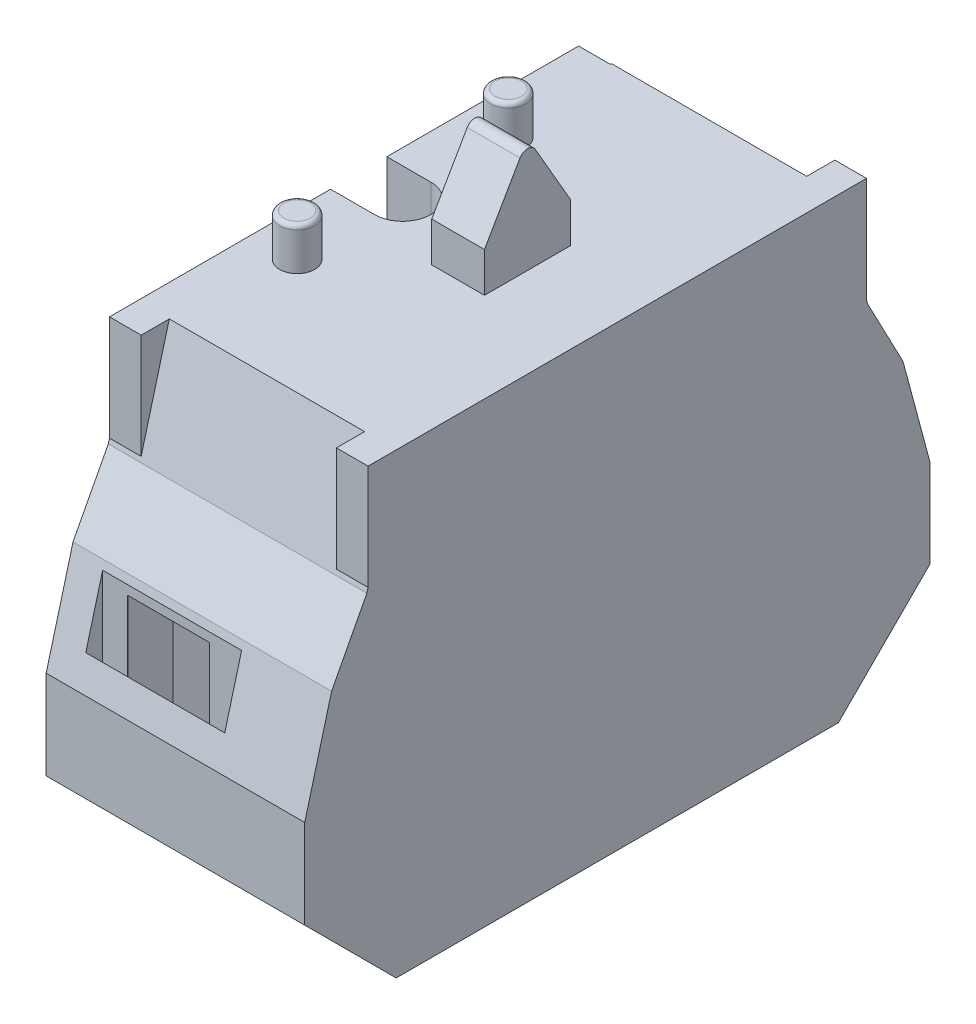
ISO-10303-21;
HEADER;
FILE_DESCRIPTION(('STEP AP214'),'2;1');
FILE_NAME('part.step','',(''),(''),'','','');
FILE_SCHEMA(('AUTOMOTIVE_DESIGN { 1 0 10303 214 1 1 1 1 }'));
ENDSEC;
DATA;
#1=APPLICATION_CONTEXT('core data for automotive mechanical design processes');
#2=APPLICATION_PROTOCOL_DEFINITION('international standard','automotive_design',2000,#1);
#3=PRODUCT_CONTEXT('',#1,'mechanical');
#4=PRODUCT('Part','Part','',(#3));
#5=PRODUCT_RELATED_PRODUCT_CATEGORY('part','',(#4));
#6=PRODUCT_DEFINITION_FORMATION('','',#4);
#7=PRODUCT_DEFINITION_CONTEXT('part definition',#1,'design');
#8=PRODUCT_DEFINITION('design','',#6,#7);
#9=PRODUCT_DEFINITION_SHAPE('','',#8);
#10=(LENGTH_UNIT() NAMED_UNIT(*) SI_UNIT(.MILLI.,.METRE.));
#11=(NAMED_UNIT(*) PLANE_ANGLE_UNIT() SI_UNIT($,.RADIAN.));
#12=(NAMED_UNIT(*) SI_UNIT($,.STERADIAN.) SOLID_ANGLE_UNIT());
#13=UNCERTAINTY_MEASURE_WITH_UNIT(LENGTH_MEASURE(1.E-05),#10,'distance_accuracy_value','');
#14=(GEOMETRIC_REPRESENTATION_CONTEXT(3) GLOBAL_UNCERTAINTY_ASSIGNED_CONTEXT((#13)) GLOBAL_UNIT_ASSIGNED_CONTEXT((#10,
#11,#12)) REPRESENTATION_CONTEXT('',''));
#15=CARTESIAN_POINT('',(0.,0.,0.));
#16=DIRECTION('',(0.,0.,1.));
#17=DIRECTION('',(1.,0.,0.));
#18=AXIS2_PLACEMENT_3D('',#15,#16,#17);
#19=CARTESIAN_POINT('',(-12.4536692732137,-31.05,-6.));
#20=DIRECTION('',(0.,1.,0.));
#21=DIRECTION('',(0.,0.,-1.));
#22=AXIS2_PLACEMENT_3D('',#19,#20,#21);
#23=PLANE('',#22);
#24=CARTESIAN_POINT('',(-12.4536692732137,-31.05,-6.));
#25=DIRECTION('',(0.,1.,0.));
#26=DIRECTION('',(-1.,0.,0.));
#27=AXIS2_PLACEMENT_3D('',#24,#25,#26);
#28=CIRCLE('',#27,1.);
#29=CARTESIAN_POINT('',(-13.4536692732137,-31.05,-6.));
#30=VERTEX_POINT('',#29);
#31=EDGE_CURVE('E786',#30,#30,#28,.T.);
#32=ORIENTED_EDGE('',*,*,#31,.F.);
#33=EDGE_LOOP('',(#32));
#34=FACE_BOUND('',#33,.T.);
#35=ADVANCED_FACE('F17',(#34),#23,.F.);
#36=CARTESIAN_POINT('',(-12.4536692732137,-31.05,6.));
#37=DIRECTION('',(0.,1.,0.));
#38=DIRECTION('',(0.,0.,-1.));
#39=AXIS2_PLACEMENT_3D('',#36,#37,#38);
#40=PLANE('',#39);
#41=CARTESIAN_POINT('',(-12.4536692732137,-31.05,6.));
#42=DIRECTION('',(0.,1.,0.));
#43=DIRECTION('',(-1.,0.,0.));
#44=AXIS2_PLACEMENT_3D('',#41,#42,#43);
#45=CIRCLE('',#44,1.);
#46=CARTESIAN_POINT('',(-13.4536692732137,-31.05,6.));
#47=VERTEX_POINT('',#46);
#48=EDGE_CURVE('E1044',#47,#47,#45,.T.);
#49=ORIENTED_EDGE('',*,*,#48,.F.);
#50=EDGE_LOOP('',(#49));
#51=FACE_BOUND('',#50,.T.);
#52=ADVANCED_FACE('F1524',(#51),#40,.F.);
#53=CARTESIAN_POINT('',(-8.35366927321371,-22.05,-10.9006436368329));
#54=DIRECTION('',(0.,0.,1.));
#55=DIRECTION('',(0.,-1.,0.));
#56=AXIS2_PLACEMENT_3D('',#53,#54,#55);
#57=PLANE('',#56);
#58=DIRECTION('',(-1.,0.,0.));
#59=VECTOR('',#58,1.);
#60=CARTESIAN_POINT('',(-8.35366927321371,-37.05,-10.9006436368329));
#61=LINE('',#60,#59);
#62=CARTESIAN_POINT('',(-7.0901305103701,-37.05,-10.9006436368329));
#63=VERTEX_POINT('',#62);
#64=CARTESIAN_POINT('',(-11.3890609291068,-37.05,-10.9006436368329));
#65=VERTEX_POINT('',#64);
#66=EDGE_CURVE('E1104',#63,#65,#61,.T.);
#67=ORIENTED_EDGE('',*,*,#66,.T.);
#68=DIRECTION('',(0.,-1.,0.));
#69=VECTOR('',#68,1.);
#70=CARTESIAN_POINT('',(-11.3890609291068,-22.05,-10.9006436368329));
#71=LINE('',#70,#69);
#72=CARTESIAN_POINT('',(-11.3890609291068,-22.05,-10.9006436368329));
#73=VERTEX_POINT('',#72);
#74=EDGE_CURVE('E11',#73,#65,#71,.T.);
#75=ORIENTED_EDGE('',*,*,#74,.F.);
#76=DIRECTION('',(-1.,0.,0.));
#77=VECTOR('',#76,1.);
#78=CARTESIAN_POINT('',(-8.35366927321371,-22.05,-10.9006436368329));
#79=LINE('',#78,#77);
#80=CARTESIAN_POINT('',(-7.0901305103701,-22.05,-10.9006436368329));
#81=VERTEX_POINT('',#80);
#82=EDGE_CURVE('E1004',#81,#73,#79,.T.);
#83=ORIENTED_EDGE('',*,*,#82,.F.);
#84=DIRECTION('',(0.,-1.,0.));
#85=VECTOR('',#84,1.);
#86=CARTESIAN_POINT('',(-7.0901305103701,-22.05,-10.9006436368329));
#87=LINE('',#86,#85);
#88=EDGE_CURVE('E1267',#81,#63,#87,.T.);
#89=ORIENTED_EDGE('',*,*,#88,.T.);
#90=EDGE_LOOP('',(#67,#75,#83,#89));
#91=FACE_BOUND('',#90,.T.);
#92=ADVANCED_FACE('F1529',(#91),#57,.F.);
#93=CARTESIAN_POINT('',(-4.22844470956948,-22.05,-5.04183925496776));
#94=DIRECTION('',(-0.633245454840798,0.,0.773951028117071));
#95=DIRECTION('',(0.,1.,0.));
#96=AXIS2_PLACEMENT_3D('',#93,#94,#95);
#97=PLANE('',#96);
#98=DIRECTION('',(-0.773951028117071,0.,-0.633245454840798));
#99=VECTOR('',#98,1.);
#100=CARTESIAN_POINT('',(-4.22844470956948,-37.05,-5.04183925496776));
#101=LINE('',#100,#99);
#102=CARTESIAN_POINT('',(-13.1536692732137,-37.05,-12.3444432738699));
#103=VERTEX_POINT('',#102);
#104=EDGE_CURVE('E1270',#65,#103,#101,.T.);
#105=ORIENTED_EDGE('',*,*,#104,.T.);
#106=DIRECTION('',(0.,-1.,0.));
#107=VECTOR('',#106,1.);
#108=CARTESIAN_POINT('',(-13.1536692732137,-22.05,-12.3444432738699));
#109=LINE('',#108,#107);
#110=CARTESIAN_POINT('',(-13.1536692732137,-22.05,-12.3444432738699));
#111=VERTEX_POINT('',#110);
#112=EDGE_CURVE('E1189',#111,#103,#109,.T.);
#113=ORIENTED_EDGE('',*,*,#112,.F.);
#114=DIRECTION('',(-0.773951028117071,0.,-0.633245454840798));
#115=VECTOR('',#114,1.);
#116=CARTESIAN_POINT('',(-4.22844470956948,-22.05,-5.04183925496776));
#117=LINE('',#116,#115);
#118=EDGE_CURVE('E879',#73,#111,#117,.T.);
#119=ORIENTED_EDGE('',*,*,#118,.F.);
#120=ORIENTED_EDGE('',*,*,#74,.T.);
#121=EDGE_LOOP('',(#105,#113,#119,#120));
#122=FACE_BOUND('',#121,.T.);
#123=ADVANCED_FACE('F19',(#122),#97,.F.);
#124=CARTESIAN_POINT('',(-8.45391458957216,-22.05,-16.5323742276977));
#125=DIRECTION('',(-0.00606346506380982,0.,-0.999981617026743));
#126=DIRECTION('',(-0.999981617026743,0.,0.00606346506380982));
#127=AXIS2_PLACEMENT_3D('',#124,#125,#126);
#128=PLANE('',#127);
#129=DIRECTION('',(0.,-1.,0.));
#130=VECTOR('',#129,1.);
#131=CARTESIAN_POINT('',(-7.0901305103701,-22.05,-16.5406436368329));
#132=LINE('',#131,#130);
#133=CARTESIAN_POINT('',(-7.0901305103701,-32.15,-16.5406436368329));
#134=VERTEX_POINT('',#133);
#135=CARTESIAN_POINT('',(-7.0901305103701,-33.0773884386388,-16.5406436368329));
#136=VERTEX_POINT('',#135);
#137=EDGE_CURVE('E28',#134,#136,#132,.T.);
#138=ORIENTED_EDGE('',*,*,#137,.F.);
#139=DIRECTION('',(-0.999981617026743,0.,0.00606346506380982));
#140=VECTOR('',#139,1.);
#141=CARTESIAN_POINT('',(-8.45391458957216,-32.15,-16.5323742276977));
#142=LINE('',#141,#140);
#143=CARTESIAN_POINT('',(-11.5286520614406,-32.15,-16.5137303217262));
#144=VERTEX_POINT('',#143);
#145=EDGE_CURVE('E713',#134,#144,#142,.T.);
#146=ORIENTED_EDGE('',*,*,#145,.T.);
#147=DIRECTION('',(0.,-1.,0.));
#148=VECTOR('',#147,1.);
#149=CARTESIAN_POINT('',(-11.5286520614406,-22.05,-16.5137303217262));
#150=LINE('',#149,#148);
#151=CARTESIAN_POINT('',(-11.5286520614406,-33.1043017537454,-16.5137303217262));
#152=VERTEX_POINT('',#151);
#153=EDGE_CURVE('E878',#144,#152,#150,.T.);
#154=ORIENTED_EDGE('',*,*,#153,.T.);
#155=DIRECTION('',(-0.99996323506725,-0.00606335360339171,0.00606335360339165));
#156=VECTOR('',#155,1.);
#157=CARTESIAN_POINT('',(-0.220905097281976,-33.0357363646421,-16.5822957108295));
#158=LINE('',#157,#156);
#159=EDGE_CURVE('E963',#136,#152,#158,.T.);
#160=ORIENTED_EDGE('',*,*,#159,.F.);
#161=EDGE_LOOP('',(#138,#146,#154,#160));
#162=FACE_BOUND('',#161,.T.);
#163=ADVANCED_FACE('F2128',(#162),#128,.F.);
#164=CARTESIAN_POINT('',(-7.0901305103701,-22.05,0.));
#165=DIRECTION('',(-1.,0.,0.));
#166=DIRECTION('',(0.,0.,1.));
#167=AXIS2_PLACEMENT_3D('',#164,#165,#166);
#168=PLANE('',#167);
#169=DIRECTION('',(0.,-0.707106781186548,0.707106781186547));
#170=VECTOR('',#169,1.);
#171=CARTESIAN_POINT('',(-7.0901305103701,-30.3340160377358,-19.2840160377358));
#172=LINE('',#171,#170);
#173=CARTESIAN_POINT('',(-7.0901305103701,-37.05,-12.5680320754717));
#174=VERTEX_POINT('',#173);
#175=EDGE_CURVE('E968',#136,#174,#172,.T.);
#176=ORIENTED_EDGE('',*,*,#175,.T.);
#177=DIRECTION('',(0.,0.,-1.));
#178=VECTOR('',#177,1.);
#179=CARTESIAN_POINT('',(-7.0901305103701,-37.05,0.));
#180=LINE('',#179,#178);
#181=EDGE_CURVE('E1099',#63,#174,#180,.T.);
#182=ORIENTED_EDGE('',*,*,#181,.F.);
#183=ORIENTED_EDGE('',*,*,#88,.F.);
#184=DIRECTION('',(0.,0.,-1.));
#185=VECTOR('',#184,1.);
#186=CARTESIAN_POINT('',(-7.0901305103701,-22.05,0.));
#187=LINE('',#186,#185);
#188=CARTESIAN_POINT('',(-7.0901305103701,-22.05,-16.3573595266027));
#189=VERTEX_POINT('',#188);
#190=EDGE_CURVE('E1008',#81,#189,#187,.T.);
#191=ORIENTED_EDGE('',*,*,#190,.T.);
#192=DIRECTION('',(0.,-1.,0.));
#193=VECTOR('',#192,1.);
#194=CARTESIAN_POINT('',(-7.0901305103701,-32.15,-16.3573595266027));
#195=LINE('',#194,#193);
#196=CARTESIAN_POINT('',(-7.0901305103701,-32.15,-16.3573595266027));
#197=VERTEX_POINT('',#196);
#198=EDGE_CURVE('E844',#189,#197,#195,.T.);
#199=ORIENTED_EDGE('',*,*,#198,.T.);
#200=DIRECTION('',(0.,0.,1.));
#201=VECTOR('',#200,1.);
#202=CARTESIAN_POINT('',(-7.0901305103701,-32.15,0.));
#203=LINE('',#202,#201);
#204=EDGE_CURVE('E709',#134,#197,#203,.T.);
#205=ORIENTED_EDGE('',*,*,#204,.F.);
#206=ORIENTED_EDGE('',*,*,#137,.T.);
#207=EDGE_LOOP('',(#176,#182,#183,#191,#199,#205,#206));
#208=FACE_BOUND('',#207,.T.);
#209=ADVANCED_FACE('F2133',(#208),#168,.T.);
#210=CARTESIAN_POINT('',(-18.1716393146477,-22.05,-9.97592666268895));
#211=DIRECTION('',(0.701441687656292,0.,0.712726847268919));
#212=DIRECTION('',(0.,-1.,0.));
#213=AXIS2_PLACEMENT_3D('',#210,#211,#212);
#214=PLANE('',#213);
#215=DIRECTION('',(0.583493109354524,0.574254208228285,-0.574254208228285));
#216=VECTOR('',#215,1.);
#217=CARTESIAN_POINT('',(-5.83342600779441,-27.4992526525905,-22.1187794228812));
#218=LINE('',#217,#216);
#219=CARTESIAN_POINT('',(-13.1536692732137,-34.7035888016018,-14.9144432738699));
#220=VERTEX_POINT('',#219);
#221=EDGE_CURVE('E967',#220,#152,#218,.T.);
#222=ORIENTED_EDGE('',*,*,#221,.T.);
#223=ORIENTED_EDGE('',*,*,#153,.F.);
#224=DIRECTION('',(0.712726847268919,0.,-0.701441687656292));
#225=VECTOR('',#224,1.);
#226=CARTESIAN_POINT('',(-18.1716393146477,-32.15,-9.97592666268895));
#227=LINE('',#226,#225);
#228=CARTESIAN_POINT('',(-11.68753863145,-32.15,-16.3573595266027));
#229=VERTEX_POINT('',#228);
#230=EDGE_CURVE('E987',#229,#144,#227,.T.);
#231=ORIENTED_EDGE('',*,*,#230,.F.);
#232=DIRECTION('',(0.,1.,0.));
#233=VECTOR('',#232,1.);
#234=CARTESIAN_POINT('',(-11.68753863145,-32.15,-16.3573595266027));
#235=LINE('',#234,#233);
#236=CARTESIAN_POINT('',(-11.68753863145,-22.05,-16.3573595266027));
#237=VERTEX_POINT('',#236);
#238=EDGE_CURVE('E1036',#229,#237,#235,.T.);
#239=ORIENTED_EDGE('',*,*,#238,.T.);
#240=DIRECTION('',(-0.712726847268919,0.,0.701441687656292));
#241=VECTOR('',#240,1.);
#242=CARTESIAN_POINT('',(-18.1716393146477,-22.05,-9.97592666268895));
#243=LINE('',#242,#241);
#244=CARTESIAN_POINT('',(-13.1536692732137,-22.05,-14.9144432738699));
#245=VERTEX_POINT('',#244);
#246=EDGE_CURVE('E875',#237,#245,#243,.T.);
#247=ORIENTED_EDGE('',*,*,#246,.T.);
#248=DIRECTION('',(0.,-1.,0.));
#249=VECTOR('',#248,1.);
#250=CARTESIAN_POINT('',(-13.1536692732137,-22.05,-14.9144432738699));
#251=LINE('',#250,#249);
#252=EDGE_CURVE('E885',#245,#220,#251,.T.);
#253=ORIENTED_EDGE('',*,*,#252,.T.);
#254=EDGE_LOOP('',(#222,#223,#231,#239,#247,#253));
#255=FACE_BOUND('',#254,.T.);
#256=ADVANCED_FACE('F2006',(#255),#214,.T.);
#257=CARTESIAN_POINT('',(-8.35366927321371,-22.05,0.));
#258=DIRECTION('',(0.,1.,0.));
#259=DIRECTION('',(0.,0.,-1.));
#260=AXIS2_PLACEMENT_3D('',#257,#258,#259);
#261=PLANE('',#260);
#262=ORIENTED_EDGE('',*,*,#190,.F.);
#263=ORIENTED_EDGE('',*,*,#82,.T.);
#264=ORIENTED_EDGE('',*,*,#118,.T.);
#265=DIRECTION('',(0.,0.,1.));
#266=VECTOR('',#265,1.);
#267=CARTESIAN_POINT('',(-13.1536692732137,-22.05,0.));
#268=LINE('',#267,#266);
#269=EDGE_CURVE('E888',#245,#111,#268,.T.);
#270=ORIENTED_EDGE('',*,*,#269,.F.);
#271=ORIENTED_EDGE('',*,*,#246,.F.);
#272=DIRECTION('',(-1.,0.,0.));
#273=VECTOR('',#272,1.);
#274=CARTESIAN_POINT('',(-8.35366927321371,-22.05,-16.3573595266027));
#275=LINE('',#274,#273);
#276=EDGE_CURVE('E848',#189,#237,#275,.T.);
#277=ORIENTED_EDGE('',*,*,#276,.F.);
#278=EDGE_LOOP('',(#262,#263,#264,#270,#271,#277));
#279=FACE_BOUND('',#278,.T.);
#280=ADVANCED_FACE('F1821',(#279),#261,.F.);
#281=CARTESIAN_POINT('',(-13.1536692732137,-22.05,0.));
#282=DIRECTION('',(1.,0.,0.));
#283=DIRECTION('',(0.,0.,1.));
#284=AXIS2_PLACEMENT_3D('',#281,#282,#283);
#285=PLANE('',#284);
#286=DIRECTION('',(0.,0.707106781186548,-0.707106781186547));
#287=VECTOR('',#286,1.);
#288=CARTESIAN_POINT('',(-13.1536692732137,-30.3340160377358,-19.2840160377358));
#289=LINE('',#288,#287);
#290=CARTESIAN_POINT('',(-13.1536692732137,-37.05,-12.5680320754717));
#291=VERTEX_POINT('',#290);
#292=EDGE_CURVE('E760',#291,#220,#289,.T.);
#293=ORIENTED_EDGE('',*,*,#292,.T.);
#294=ORIENTED_EDGE('',*,*,#252,.F.);
#295=ORIENTED_EDGE('',*,*,#269,.T.);
#296=ORIENTED_EDGE('',*,*,#112,.T.);
#297=DIRECTION('',(0.,0.,1.));
#298=VECTOR('',#297,1.);
#299=CARTESIAN_POINT('',(-13.1536692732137,-37.05,0.));
#300=LINE('',#299,#298);
#301=EDGE_CURVE('E962',#291,#103,#300,.T.);
#302=ORIENTED_EDGE('',*,*,#301,.F.);
#303=EDGE_LOOP('',(#293,#294,#295,#296,#302));
#304=FACE_BOUND('',#303,.T.);
#305=ADVANCED_FACE('F1815',(#304),#285,.T.);
#306=CARTESIAN_POINT('',(-8.35366927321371,-22.05,0.));
#307=DIRECTION('',(0.,1.,0.));
#308=DIRECTION('',(0.,0.,-1.));
#309=AXIS2_PLACEMENT_3D('',#306,#307,#308);
#310=PLANE('',#309);
#311=DIRECTION('',(-1.,0.,0.));
#312=VECTOR('',#311,1.);
#313=CARTESIAN_POINT('',(-8.35366927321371,-22.05,16.3573595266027));
#314=LINE('',#313,#312);
#315=CARTESIAN_POINT('',(-7.0890609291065,-22.05,16.3573595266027));
#316=VERTEX_POINT('',#315);
#317=CARTESIAN_POINT('',(-11.7350679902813,-22.05,16.3573595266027));
#318=VERTEX_POINT('',#317);
#319=EDGE_CURVE('E1086',#316,#318,#314,.T.);
#320=ORIENTED_EDGE('',*,*,#319,.T.);
#321=DIRECTION('',(-0.700914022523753,0.,-0.713245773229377));
#322=VECTOR('',#321,1.);
#323=CARTESIAN_POINT('',(-18.2512888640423,-22.05,9.72649347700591));
#324=LINE('',#323,#322);
#325=CARTESIAN_POINT('',(-13.1536692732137,-22.05,14.9137996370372));
#326=VERTEX_POINT('',#325);
#327=EDGE_CURVE('E662',#318,#326,#324,.T.);
#328=ORIENTED_EDGE('',*,*,#327,.T.);
#329=DIRECTION('',(0.,0.,1.));
#330=VECTOR('',#329,1.);
#331=CARTESIAN_POINT('',(-13.1536692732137,-22.05,0.));
#332=LINE('',#331,#330);
#333=CARTESIAN_POINT('',(-13.1536692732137,-22.05,12.3437996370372));
#334=VERTEX_POINT('',#333);
#335=EDGE_CURVE('E774',#334,#326,#332,.T.);
#336=ORIENTED_EDGE('',*,*,#335,.F.);
#337=DIRECTION('',(-0.773951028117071,0.,0.633245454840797));
#338=VECTOR('',#337,1.);
#339=CARTESIAN_POINT('',(-4.22876015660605,-22.05,5.04145371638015));
#340=LINE('',#339,#338);
#341=CARTESIAN_POINT('',(-11.3890609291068,-22.05,10.9));
#342=VERTEX_POINT('',#341);
#343=EDGE_CURVE('E889',#342,#334,#340,.T.);
#344=ORIENTED_EDGE('',*,*,#343,.F.);
#345=DIRECTION('',(-1.,0.,0.));
#346=VECTOR('',#345,1.);
#347=CARTESIAN_POINT('',(-8.3536692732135,-22.05,10.9));
#348=LINE('',#347,#346);
#349=CARTESIAN_POINT('',(-7.0890609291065,-22.05,10.9));
#350=VERTEX_POINT('',#349);
#351=EDGE_CURVE('E1095',#350,#342,#348,.T.);
#352=ORIENTED_EDGE('',*,*,#351,.F.);
#353=DIRECTION('',(0.,0.,-1.));
#354=VECTOR('',#353,1.);
#355=CARTESIAN_POINT('',(-7.0890609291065,-22.05,0.));
#356=LINE('',#355,#354);
#357=EDGE_CURVE('E1125',#316,#350,#356,.T.);
#358=ORIENTED_EDGE('',*,*,#357,.F.);
#359=EDGE_LOOP('',(#320,#328,#336,#344,#352,#358));
#360=FACE_BOUND('',#359,.T.);
#361=ADVANCED_FACE('F1820',(#360),#310,.F.);
#362=CARTESIAN_POINT('',(-4.22876015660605,-22.05,5.04145371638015));
#363=DIRECTION('',(0.633245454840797,0.,0.773951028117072));
#364=DIRECTION('',(0.,-1.,0.));
#365=AXIS2_PLACEMENT_3D('',#362,#363,#364);
#366=PLANE('',#365);
#367=DIRECTION('',(-0.773951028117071,0.,0.633245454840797));
#368=VECTOR('',#367,1.);
#369=CARTESIAN_POINT('',(-4.22876015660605,-37.05,5.04145371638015));
#370=LINE('',#369,#368);
#371=CARTESIAN_POINT('',(-11.3890609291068,-37.05,10.9));
#372=VERTEX_POINT('',#371);
#373=CARTESIAN_POINT('',(-13.1536692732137,-37.05,12.3437996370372));
#374=VERTEX_POINT('',#373);
#375=EDGE_CURVE('E1058',#372,#374,#370,.T.);
#376=ORIENTED_EDGE('',*,*,#375,.F.);
#377=DIRECTION('',(0.,-1.,0.));
#378=VECTOR('',#377,1.);
#379=CARTESIAN_POINT('',(-11.3890609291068,-22.05,10.9));
#380=LINE('',#379,#378);
#381=EDGE_CURVE('E1092',#342,#372,#380,.T.);
#382=ORIENTED_EDGE('',*,*,#381,.F.);
#383=ORIENTED_EDGE('',*,*,#343,.T.);
#384=DIRECTION('',(0.,-1.,0.));
#385=VECTOR('',#384,1.);
#386=CARTESIAN_POINT('',(-13.1536692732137,-22.05,12.3437996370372));
#387=LINE('',#386,#385);
#388=EDGE_CURVE('E771',#334,#374,#387,.T.);
#389=ORIENTED_EDGE('',*,*,#388,.T.);
#390=EDGE_LOOP('',(#376,#382,#383,#389));
#391=FACE_BOUND('',#390,.T.);
#392=ADVANCED_FACE('F1516',(#391),#366,.T.);
#393=CARTESIAN_POINT('',(-8.3536692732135,-22.05,10.9));
#394=DIRECTION('',(0.,0.,1.));
#395=DIRECTION('',(1.,0.,0.));
#396=AXIS2_PLACEMENT_3D('',#393,#394,#395);
#397=PLANE('',#396);
#398=DIRECTION('',(-1.,0.,0.));
#399=VECTOR('',#398,1.);
#400=CARTESIAN_POINT('',(-8.3536692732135,-37.05,10.9));
#401=LINE('',#400,#399);
#402=CARTESIAN_POINT('',(-7.0890609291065,-37.05,10.9));
#403=VERTEX_POINT('',#402);
#404=EDGE_CURVE('E973',#403,#372,#401,.T.);
#405=ORIENTED_EDGE('',*,*,#404,.F.);
#406=DIRECTION('',(0.,-1.,0.));
#407=VECTOR('',#406,1.);
#408=CARTESIAN_POINT('',(-7.0890609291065,-22.05,10.9));
#409=LINE('',#408,#407);
#410=EDGE_CURVE('E1122',#350,#403,#409,.T.);
#411=ORIENTED_EDGE('',*,*,#410,.F.);
#412=ORIENTED_EDGE('',*,*,#351,.T.);
#413=ORIENTED_EDGE('',*,*,#381,.T.);
#414=EDGE_LOOP('',(#405,#411,#412,#413));
#415=FACE_BOUND('',#414,.T.);
#416=ADVANCED_FACE('F1511',(#415),#397,.T.);
#417=CARTESIAN_POINT('',(-7.0890609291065,-22.05,0.));
#418=DIRECTION('',(-1.,0.,0.));
#419=DIRECTION('',(0.,0.,1.));
#420=AXIS2_PLACEMENT_3D('',#417,#418,#419);
#421=PLANE('',#420);
#422=DIRECTION('',(0.,0.707106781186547,0.707106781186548));
#423=VECTOR('',#422,1.);
#424=CARTESIAN_POINT('',(-7.0890609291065,-30.3340160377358,19.2840160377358));
#425=LINE('',#424,#423);
#426=CARTESIAN_POINT('',(-7.0890609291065,-37.05,12.5680320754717));
#427=VERTEX_POINT('',#426);
#428=CARTESIAN_POINT('',(-7.0890609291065,-33.0780320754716,16.54));
#429=VERTEX_POINT('',#428);
#430=EDGE_CURVE('E1059',#427,#429,#425,.T.);
#431=ORIENTED_EDGE('',*,*,#430,.T.);
#432=DIRECTION('',(0.,-1.,0.));
#433=VECTOR('',#432,1.);
#434=CARTESIAN_POINT('',(-7.0890609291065,-22.05,16.54));
#435=LINE('',#434,#433);
#436=CARTESIAN_POINT('',(-7.0890609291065,-32.15,16.54));
#437=VERTEX_POINT('',#436);
#438=EDGE_CURVE('E661',#437,#429,#435,.T.);
#439=ORIENTED_EDGE('',*,*,#438,.F.);
#440=DIRECTION('',(0.,0.,1.));
#441=VECTOR('',#440,1.);
#442=CARTESIAN_POINT('',(-7.0890609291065,-32.15,0.));
#443=LINE('',#442,#441);
#444=CARTESIAN_POINT('',(-7.0890609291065,-32.15,16.3573595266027));
#445=VERTEX_POINT('',#444);
#446=EDGE_CURVE('E670',#445,#437,#443,.T.);
#447=ORIENTED_EDGE('',*,*,#446,.F.);
#448=DIRECTION('',(0.,-1.,0.));
#449=VECTOR('',#448,1.);
#450=CARTESIAN_POINT('',(-7.0890609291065,-32.15,16.3573595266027));
#451=LINE('',#450,#449);
#452=EDGE_CURVE('E1151',#316,#445,#451,.T.);
#453=ORIENTED_EDGE('',*,*,#452,.F.);
#454=ORIENTED_EDGE('',*,*,#357,.T.);
#455=ORIENTED_EDGE('',*,*,#410,.T.);
#456=DIRECTION('',(0.,0.,-1.));
#457=VECTOR('',#456,1.);
#458=CARTESIAN_POINT('',(-7.0890609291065,-37.05,0.));
#459=LINE('',#458,#457);
#460=EDGE_CURVE('E969',#427,#403,#459,.T.);
#461=ORIENTED_EDGE('',*,*,#460,.F.);
#462=EDGE_LOOP('',(#431,#439,#447,#453,#454,#455,#461));
#463=FACE_BOUND('',#462,.T.);
#464=ADVANCED_FACE('F1428',(#463),#421,.T.);
#465=CARTESIAN_POINT('',(-8.35366927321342,-22.05,16.54));
#466=DIRECTION('',(0.,0.,-1.));
#467=DIRECTION('',(-1.,0.,0.));
#468=AXIS2_PLACEMENT_3D('',#465,#466,#467);
#469=PLANE('',#468);
#470=DIRECTION('',(-1.,0.,0.));
#471=VECTOR('',#470,1.);
#472=CARTESIAN_POINT('',(-0.253669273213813,-33.0780320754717,16.54));
#473=LINE('',#472,#471);
#474=CARTESIAN_POINT('',(-11.5555853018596,-33.0780320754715,16.54));
#475=VERTEX_POINT('',#474);
#476=EDGE_CURVE('E21',#429,#475,#473,.T.);
#477=ORIENTED_EDGE('',*,*,#476,.T.);
#478=DIRECTION('',(0.,-1.,0.));
#479=VECTOR('',#478,1.);
#480=CARTESIAN_POINT('',(-11.5555853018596,-22.05,16.54));
#481=LINE('',#480,#479);
#482=CARTESIAN_POINT('',(-11.5555853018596,-32.15,16.54));
#483=VERTEX_POINT('',#482);
#484=EDGE_CURVE('E650',#483,#475,#481,.T.);
#485=ORIENTED_EDGE('',*,*,#484,.F.);
#486=DIRECTION('',(-1.,0.,0.));
#487=VECTOR('',#486,1.);
#488=CARTESIAN_POINT('',(-8.35366927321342,-32.15,16.54));
#489=LINE('',#488,#487);
#490=EDGE_CURVE('E653',#437,#483,#489,.T.);
#491=ORIENTED_EDGE('',*,*,#490,.F.);
#492=ORIENTED_EDGE('',*,*,#438,.T.);
#493=EDGE_LOOP('',(#477,#485,#491,#492));
#494=FACE_BOUND('',#493,.T.);
#495=ADVANCED_FACE('F652',(#494),#469,.T.);
#496=CARTESIAN_POINT('',(-18.2512888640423,-22.05,9.72649347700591));
#497=DIRECTION('',(-0.713245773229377,0.,0.700914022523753));
#498=DIRECTION('',(0.,1.,0.));
#499=AXIS2_PLACEMENT_3D('',#496,#497,#498);
#500=PLANE('',#499);
#501=DIRECTION('',(0.,-1.,0.));
#502=VECTOR('',#501,1.);
#503=CARTESIAN_POINT('',(-13.1536692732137,-22.05,14.9137996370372));
#504=LINE('',#503,#502);
#505=CARTESIAN_POINT('',(-13.1536692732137,-34.7042324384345,14.9137996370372));
#506=VERTEX_POINT('',#505);
#507=EDGE_CURVE('E1039',#326,#506,#504,.T.);
#508=ORIENTED_EDGE('',*,*,#507,.F.);
#509=ORIENTED_EDGE('',*,*,#327,.F.);
#510=DIRECTION('',(0.,-1.,0.));
#511=VECTOR('',#510,1.);
#512=CARTESIAN_POINT('',(-11.7350679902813,-32.15,16.3573595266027));
#513=LINE('',#512,#511);
#514=CARTESIAN_POINT('',(-11.7350679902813,-32.15,16.3573595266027));
#515=VERTEX_POINT('',#514);
#516=EDGE_CURVE('E678',#318,#515,#513,.T.);
#517=ORIENTED_EDGE('',*,*,#516,.T.);
#518=DIRECTION('',(0.700914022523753,0.,0.713245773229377));
#519=VECTOR('',#518,1.);
#520=CARTESIAN_POINT('',(-18.2512888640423,-32.15,9.72649347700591));
#521=LINE('',#520,#519);
#522=EDGE_CURVE('E667',#515,#483,#521,.T.);
#523=ORIENTED_EDGE('',*,*,#522,.T.);
#524=ORIENTED_EDGE('',*,*,#484,.T.);
#525=DIRECTION('',(0.570637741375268,0.580677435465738,0.580677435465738));
#526=VECTOR('',#525,1.);
#527=CARTESIAN_POINT('',(-6.05687652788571,-27.4825800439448,22.1354520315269));
#528=LINE('',#527,#526);
#529=EDGE_CURVE('E1073',#506,#475,#528,.T.);
#530=ORIENTED_EDGE('',*,*,#529,.F.);
#531=EDGE_LOOP('',(#508,#509,#517,#523,#524,#530));
#532=FACE_BOUND('',#531,.T.);
#533=ADVANCED_FACE('F676',(#532),#500,.F.);
#534=CARTESIAN_POINT('',(-13.1536692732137,-22.05,0.));
#535=DIRECTION('',(1.,0.,0.));
#536=DIRECTION('',(0.,0.,1.));
#537=AXIS2_PLACEMENT_3D('',#534,#535,#536);
#538=PLANE('',#537);
#539=DIRECTION('',(0.,-0.707106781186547,-0.707106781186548));
#540=VECTOR('',#539,1.);
#541=CARTESIAN_POINT('',(-13.1536692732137,-30.3340160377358,19.2840160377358));
#542=LINE('',#541,#540);
#543=CARTESIAN_POINT('',(-13.1536692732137,-37.05,12.5680320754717));
#544=VERTEX_POINT('',#543);
#545=EDGE_CURVE('E1070',#506,#544,#542,.T.);
#546=ORIENTED_EDGE('',*,*,#545,.T.);
#547=DIRECTION('',(0.,0.,1.));
#548=VECTOR('',#547,1.);
#549=CARTESIAN_POINT('',(-13.1536692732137,-37.05,0.));
#550=LINE('',#549,#548);
#551=EDGE_CURVE('E864',#374,#544,#550,.T.);
#552=ORIENTED_EDGE('',*,*,#551,.F.);
#553=ORIENTED_EDGE('',*,*,#388,.F.);
#554=ORIENTED_EDGE('',*,*,#335,.T.);
#555=ORIENTED_EDGE('',*,*,#507,.T.);
#556=EDGE_LOOP('',(#546,#552,#553,#554,#555));
#557=FACE_BOUND('',#556,.T.);
#558=ADVANCED_FACE('F1808',(#557),#538,.T.);
#559=CARTESIAN_POINT('',(-8.35366927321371,-33.8,0.));
#560=DIRECTION('',(0.,1.,0.));
#561=DIRECTION('',(0.,0.,-1.));
#562=AXIS2_PLACEMENT_3D('',#559,#560,#561);
#563=PLANE('',#562);
#564=CARTESIAN_POINT('',(-12.4536692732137,-33.8,0.));
#565=DIRECTION('',(0.,1.,0.));
#566=DIRECTION('',(-1.,0.,0.));
#567=AXIS2_PLACEMENT_3D('',#564,#565,#566);
#568=CIRCLE('',#567,2.);
#569=CARTESIAN_POINT('',(-12.4536692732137,-33.8,2.));
#570=VERTEX_POINT('',#569);
#571=CARTESIAN_POINT('',(-12.4536692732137,-33.8,-2.));
#572=VERTEX_POINT('',#571);
#573=EDGE_CURVE('E759',#570,#572,#568,.T.);
#574=ORIENTED_EDGE('',*,*,#573,.T.);
#575=DIRECTION('',(-1.,0.,0.));
#576=VECTOR('',#575,1.);
#577=CARTESIAN_POINT('',(-8.35366927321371,-33.8,-2.));
#578=LINE('',#577,#576);
#579=CARTESIAN_POINT('',(-14.9536692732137,-33.8,-2.));
#580=VERTEX_POINT('',#579);
#581=EDGE_CURVE('E1045',#572,#580,#578,.T.);
#582=ORIENTED_EDGE('',*,*,#581,.T.);
#583=DIRECTION('',(0.,0.,-1.));
#584=VECTOR('',#583,1.);
#585=CARTESIAN_POINT('',(-14.9536692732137,-33.8,0.));
#586=LINE('',#585,#584);
#587=CARTESIAN_POINT('',(-14.9536692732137,-33.8,-3.00000000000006));
#588=VERTEX_POINT('',#587);
#589=EDGE_CURVE('E1140',#580,#588,#586,.T.);
#590=ORIENTED_EDGE('',*,*,#589,.T.);
#591=DIRECTION('',(-1.,0.,0.));
#592=VECTOR('',#591,1.);
#593=CARTESIAN_POINT('',(-8.35366927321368,-33.8,-3.));
#594=LINE('',#593,#592);
#595=CARTESIAN_POINT('',(-10.4536692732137,-33.8,-3.));
#596=VERTEX_POINT('',#595);
#597=EDGE_CURVE('E775',#596,#588,#594,.T.);
#598=ORIENTED_EDGE('',*,*,#597,.F.);
#599=DIRECTION('',(-0.707106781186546,0.,-0.707106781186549));
#600=VECTOR('',#599,1.);
#601=CARTESIAN_POINT('',(-7.90366927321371,-33.8,-0.45));
#602=LINE('',#601,#600);
#603=CARTESIAN_POINT('',(-9.4536692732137,-33.8,-2.));
#604=VERTEX_POINT('',#603);
#605=EDGE_CURVE('E1221',#604,#596,#602,.T.);
#606=ORIENTED_EDGE('',*,*,#605,.F.);
#607=DIRECTION('',(0.,0.,-1.));
#608=VECTOR('',#607,1.);
#609=CARTESIAN_POINT('',(-9.45366927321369,-33.8,0.));
#610=LINE('',#609,#608);
#611=CARTESIAN_POINT('',(-9.45366927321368,-33.8,2.0000000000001));
#612=VERTEX_POINT('',#611);
#613=EDGE_CURVE('E1049',#612,#604,#610,.T.);
#614=ORIENTED_EDGE('',*,*,#613,.F.);
#615=DIRECTION('',(-0.707106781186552,0.,0.707106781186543));
#616=VECTOR('',#615,1.);
#617=CARTESIAN_POINT('',(-7.90366927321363,-33.8,0.45000000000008));
#618=LINE('',#617,#616);
#619=CARTESIAN_POINT('',(-10.4536692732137,-33.8,3.00000000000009));
#620=VERTEX_POINT('',#619);
#621=EDGE_CURVE('E779',#612,#620,#618,.T.);
#622=ORIENTED_EDGE('',*,*,#621,.T.);
#623=DIRECTION('',(-1.,0.,0.));
#624=VECTOR('',#623,1.);
#625=CARTESIAN_POINT('',(-8.35366927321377,-33.8,3.00000000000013));
#626=LINE('',#625,#624);
#627=CARTESIAN_POINT('',(-14.9536692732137,-33.8,3.));
#628=VERTEX_POINT('',#627);
#629=EDGE_CURVE('E780',#620,#628,#626,.T.);
#630=ORIENTED_EDGE('',*,*,#629,.T.);
#631=DIRECTION('',(0.,0.,-1.));
#632=VECTOR('',#631,1.);
#633=CARTESIAN_POINT('',(-14.9536692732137,-33.8,0.));
#634=LINE('',#633,#632);
#635=CARTESIAN_POINT('',(-14.9536692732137,-33.8,2.));
#636=VERTEX_POINT('',#635);
#637=EDGE_CURVE('E814',#628,#636,#634,.T.);
#638=ORIENTED_EDGE('',*,*,#637,.T.);
#639=DIRECTION('',(-1.,0.,0.));
#640=VECTOR('',#639,1.);
#641=CARTESIAN_POINT('',(-8.35366927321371,-33.8,2.));
#642=LINE('',#641,#640);
#643=EDGE_CURVE('E870',#570,#636,#642,.T.);
#644=ORIENTED_EDGE('',*,*,#643,.F.);
#645=EDGE_LOOP('',(#574,#582,#590,#598,#606,#614,#622,#630,#638,#644));
#646=FACE_BOUND('',#645,.T.);
#647=ADVANCED_FACE('F1953',(#646),#563,.F.);
#648=CARTESIAN_POINT('',(-8.35366927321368,-33.8,-3.));
#649=DIRECTION('',(0.,0.,1.));
#650=DIRECTION('',(1.,0.,0.));
#651=AXIS2_PLACEMENT_3D('',#648,#649,#650);
#652=PLANE('',#651);
#653=DIRECTION('',(-1.,0.,0.));
#654=VECTOR('',#653,1.);
#655=CARTESIAN_POINT('',(-8.35366927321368,-37.05,-3.));
#656=LINE('',#655,#654);
#657=CARTESIAN_POINT('',(-10.4536692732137,-37.05,-3.));
#658=VERTEX_POINT('',#657);
#659=CARTESIAN_POINT('',(-14.9536692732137,-37.05,-3.00000000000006));
#660=VERTEX_POINT('',#659);
#661=EDGE_CURVE('E907',#658,#660,#656,.T.);
#662=ORIENTED_EDGE('',*,*,#661,.F.);
#663=DIRECTION('',(0.,-1.,0.));
#664=VECTOR('',#663,1.);
#665=CARTESIAN_POINT('',(-10.4536692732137,-33.8,-3.));
#666=LINE('',#665,#664);
#667=EDGE_CURVE('E1218',#596,#658,#666,.T.);
#668=ORIENTED_EDGE('',*,*,#667,.F.);
#669=ORIENTED_EDGE('',*,*,#597,.T.);
#670=DIRECTION('',(0.,-1.,0.));
#671=VECTOR('',#670,1.);
#672=CARTESIAN_POINT('',(-14.9536692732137,-33.8,-3.00000000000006));
#673=LINE('',#672,#671);
#674=EDGE_CURVE('E1422',#588,#660,#673,.T.);
#675=ORIENTED_EDGE('',*,*,#674,.T.);
#676=EDGE_LOOP('',(#662,#668,#669,#675));
#677=FACE_BOUND('',#676,.T.);
#678=ADVANCED_FACE('F1555',(#677),#652,.T.);
#679=CARTESIAN_POINT('',(-7.90366927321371,-33.8,-0.45));
#680=DIRECTION('',(-0.707106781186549,0.,0.707106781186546));
#681=DIRECTION('',(0.,1.,0.));
#682=AXIS2_PLACEMENT_3D('',#679,#680,#681);
#683=PLANE('',#682);
#684=DIRECTION('',(-0.707106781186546,0.,-0.707106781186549));
#685=VECTOR('',#684,1.);
#686=CARTESIAN_POINT('',(-7.90366927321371,-37.05,-0.45));
#687=LINE('',#686,#685);
#688=CARTESIAN_POINT('',(-9.4536692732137,-37.05,-2.));
#689=VERTEX_POINT('',#688);
#690=EDGE_CURVE('E912',#689,#658,#687,.T.);
#691=ORIENTED_EDGE('',*,*,#690,.F.);
#692=DIRECTION('',(0.,-1.,0.));
#693=VECTOR('',#692,1.);
#694=CARTESIAN_POINT('',(-9.4536692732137,-33.8,-2.));
#695=LINE('',#694,#693);
#696=EDGE_CURVE('E1053',#604,#689,#695,.T.);
#697=ORIENTED_EDGE('',*,*,#696,.F.);
#698=ORIENTED_EDGE('',*,*,#605,.T.);
#699=ORIENTED_EDGE('',*,*,#667,.T.);
#700=EDGE_LOOP('',(#691,#697,#698,#699));
#701=FACE_BOUND('',#700,.T.);
#702=ADVANCED_FACE('F1549',(#701),#683,.T.);
#703=CARTESIAN_POINT('',(-9.45366927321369,-33.8,0.));
#704=DIRECTION('',(-1.,0.,0.));
#705=DIRECTION('',(0.,1.,0.));
#706=AXIS2_PLACEMENT_3D('',#703,#704,#705);
#707=PLANE('',#706);
#708=DIRECTION('',(0.,0.,-1.));
#709=VECTOR('',#708,1.);
#710=CARTESIAN_POINT('',(-9.45366927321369,-37.05,0.));
#711=LINE('',#710,#709);
#712=CARTESIAN_POINT('',(-9.45366927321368,-37.05,2.0000000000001));
#713=VERTEX_POINT('',#712);
#714=EDGE_CURVE('E954',#713,#689,#711,.T.);
#715=ORIENTED_EDGE('',*,*,#714,.F.);
#716=DIRECTION('',(0.,-1.,0.));
#717=VECTOR('',#716,1.);
#718=CARTESIAN_POINT('',(-9.45366927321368,-33.8,2.0000000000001));
#719=LINE('',#718,#717);
#720=EDGE_CURVE('E1054',#612,#713,#719,.T.);
#721=ORIENTED_EDGE('',*,*,#720,.F.);
#722=ORIENTED_EDGE('',*,*,#613,.T.);
#723=ORIENTED_EDGE('',*,*,#696,.T.);
#724=EDGE_LOOP('',(#715,#721,#722,#723));
#725=FACE_BOUND('',#724,.T.);
#726=ADVANCED_FACE('F1554',(#725),#707,.T.);
#727=CARTESIAN_POINT('',(-7.90366927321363,-33.8,0.45000000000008));
#728=DIRECTION('',(0.707106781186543,0.,0.707106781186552));
#729=DIRECTION('',(0.,-1.,0.));
#730=AXIS2_PLACEMENT_3D('',#727,#728,#729);
#731=PLANE('',#730);
#732=DIRECTION('',(-0.707106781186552,0.,0.707106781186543));
#733=VECTOR('',#732,1.);
#734=CARTESIAN_POINT('',(-7.90366927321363,-37.05,0.45000000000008));
#735=LINE('',#734,#733);
#736=CARTESIAN_POINT('',(-10.4536692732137,-37.05,3.00000000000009));
#737=VERTEX_POINT('',#736);
#738=EDGE_CURVE('E702',#713,#737,#735,.T.);
#739=ORIENTED_EDGE('',*,*,#738,.T.);
#740=DIRECTION('',(0.,-1.,0.));
#741=VECTOR('',#740,1.);
#742=CARTESIAN_POINT('',(-10.4536692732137,-33.8,3.00000000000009));
#743=LINE('',#742,#741);
#744=EDGE_CURVE('E776',#620,#737,#743,.T.);
#745=ORIENTED_EDGE('',*,*,#744,.F.);
#746=ORIENTED_EDGE('',*,*,#621,.F.);
#747=ORIENTED_EDGE('',*,*,#720,.T.);
#748=EDGE_LOOP('',(#739,#745,#746,#747));
#749=FACE_BOUND('',#748,.T.);
#750=ADVANCED_FACE('F1733',(#749),#731,.F.);
#751=CARTESIAN_POINT('',(-8.35366927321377,-33.8,3.00000000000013));
#752=DIRECTION('',(0.,0.,1.));
#753=DIRECTION('',(1.,0.,0.));
#754=AXIS2_PLACEMENT_3D('',#751,#752,#753);
#755=PLANE('',#754);
#756=DIRECTION('',(-1.,0.,0.));
#757=VECTOR('',#756,1.);
#758=CARTESIAN_POINT('',(-8.35366927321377,-37.05,3.00000000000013));
#759=LINE('',#758,#757);
#760=CARTESIAN_POINT('',(-14.9536692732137,-37.05,3.));
#761=VERTEX_POINT('',#760);
#762=EDGE_CURVE('E698',#737,#761,#759,.T.);
#763=ORIENTED_EDGE('',*,*,#762,.T.);
#764=DIRECTION('',(0.,-1.,0.));
#765=VECTOR('',#764,1.);
#766=CARTESIAN_POINT('',(-14.9536692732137,-33.8,3.));
#767=LINE('',#766,#765);
#768=EDGE_CURVE('E1263',#628,#761,#767,.T.);
#769=ORIENTED_EDGE('',*,*,#768,.F.);
#770=ORIENTED_EDGE('',*,*,#629,.F.);
#771=ORIENTED_EDGE('',*,*,#744,.T.);
#772=EDGE_LOOP('',(#763,#769,#770,#771));
#773=FACE_BOUND('',#772,.T.);
#774=ADVANCED_FACE('F1491',(#773),#755,.F.);
#775=CARTESIAN_POINT('',(-8.35366927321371,-30.79,0.));
#776=DIRECTION('',(0.,1.,0.));
#777=DIRECTION('',(0.,0.,-1.));
#778=AXIS2_PLACEMENT_3D('',#775,#776,#777);
#779=PLANE('',#778);
#780=DIRECTION('',(0.,0.,-1.));
#781=VECTOR('',#780,1.);
#782=CARTESIAN_POINT('',(-8.35366927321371,-30.79,0.));
#783=LINE('',#782,#781);
#784=CARTESIAN_POINT('',(-8.35366927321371,-30.79,2.45));
#785=VERTEX_POINT('',#784);
#786=CARTESIAN_POINT('',(-8.35366927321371,-30.79,-2.45));
#787=VERTEX_POINT('',#786);
#788=EDGE_CURVE('E897',#785,#787,#783,.T.);
#789=ORIENTED_EDGE('',*,*,#788,.T.);
#790=DIRECTION('',(-1.,0.,0.));
#791=VECTOR('',#790,1.);
#792=CARTESIAN_POINT('',(-8.35366927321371,-30.79,-2.45));
#793=LINE('',#792,#791);
#794=CARTESIAN_POINT('',(-5.35366927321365,-30.79,-2.45));
#795=VERTEX_POINT('',#794);
#796=EDGE_CURVE('E921',#795,#787,#793,.T.);
#797=ORIENTED_EDGE('',*,*,#796,.F.);
#798=DIRECTION('',(0.,0.,1.));
#799=VECTOR('',#798,1.);
#800=CARTESIAN_POINT('',(-5.35366927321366,-30.79,0.));
#801=LINE('',#800,#799);
#802=CARTESIAN_POINT('',(-5.35366927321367,-30.79,2.45));
#803=VERTEX_POINT('',#802);
#804=EDGE_CURVE('E805',#795,#803,#801,.T.);
#805=ORIENTED_EDGE('',*,*,#804,.T.);
#806=DIRECTION('',(-1.,0.,0.));
#807=VECTOR('',#806,1.);
#808=CARTESIAN_POINT('',(-8.35366927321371,-30.79,2.45));
#809=LINE('',#808,#807);
#810=EDGE_CURVE('E941',#803,#785,#809,.T.);
#811=ORIENTED_EDGE('',*,*,#810,.T.);
#812=EDGE_LOOP('',(#789,#797,#805,#811));
#813=FACE_BOUND('',#812,.T.);
#814=ADVANCED_FACE('F1485',(#813),#779,.F.);
#815=CARTESIAN_POINT('',(-8.35366927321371,-30.79,-2.45));
#816=DIRECTION('',(0.,0.,1.));
#817=DIRECTION('',(0.,-1.,0.));
#818=AXIS2_PLACEMENT_3D('',#815,#816,#817);
#819=PLANE('',#818);
#820=DIRECTION('',(-1.,0.,0.));
#821=VECTOR('',#820,1.);
#822=CARTESIAN_POINT('',(-8.35366927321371,-37.05,-2.45));
#823=LINE('',#822,#821);
#824=CARTESIAN_POINT('',(-5.35366927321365,-37.05,-2.45));
#825=VERTEX_POINT('',#824);
#826=CARTESIAN_POINT('',(-8.35366927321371,-37.05,-2.45));
#827=VERTEX_POINT('',#826);
#828=EDGE_CURVE('E1330',#825,#827,#823,.T.);
#829=ORIENTED_EDGE('',*,*,#828,.F.);
#830=DIRECTION('',(0.,-1.,0.));
#831=VECTOR('',#830,1.);
#832=CARTESIAN_POINT('',(-5.35366927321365,-30.79,-2.45));
#833=LINE('',#832,#831);
#834=EDGE_CURVE('E808',#795,#825,#833,.T.);
#835=ORIENTED_EDGE('',*,*,#834,.F.);
#836=ORIENTED_EDGE('',*,*,#796,.T.);
#837=DIRECTION('',(0.,-1.,0.));
#838=VECTOR('',#837,1.);
#839=CARTESIAN_POINT('',(-8.35366927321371,-30.79,-2.45));
#840=LINE('',#839,#838);
#841=EDGE_CURVE('E894',#787,#827,#840,.T.);
#842=ORIENTED_EDGE('',*,*,#841,.T.);
#843=EDGE_LOOP('',(#829,#835,#836,#842));
#844=FACE_BOUND('',#843,.T.);
#845=ADVANCED_FACE('F1490',(#844),#819,.T.);
#846=CARTESIAN_POINT('',(-5.35366927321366,-30.79,0.));
#847=DIRECTION('',(1.,0.,0.));
#848=DIRECTION('',(0.,0.,1.));
#849=AXIS2_PLACEMENT_3D('',#846,#847,#848);
#850=PLANE('',#849);
#851=DIRECTION('',(0.,0.,1.));
#852=VECTOR('',#851,1.);
#853=CARTESIAN_POINT('',(-5.35366927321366,-37.05,0.));
#854=LINE('',#853,#852);
#855=CARTESIAN_POINT('',(-5.35366927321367,-37.05,2.45));
#856=VERTEX_POINT('',#855);
#857=EDGE_CURVE('E765',#825,#856,#854,.T.);
#858=ORIENTED_EDGE('',*,*,#857,.T.);
#859=DIRECTION('',(0.,-1.,0.));
#860=VECTOR('',#859,1.);
#861=CARTESIAN_POINT('',(-5.35366927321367,-30.79,2.45));
#862=LINE('',#861,#860);
#863=EDGE_CURVE('E809',#803,#856,#862,.T.);
#864=ORIENTED_EDGE('',*,*,#863,.F.);
#865=ORIENTED_EDGE('',*,*,#804,.F.);
#866=ORIENTED_EDGE('',*,*,#834,.T.);
#867=EDGE_LOOP('',(#858,#864,#865,#866));
#868=FACE_BOUND('',#867,.T.);
#869=ADVANCED_FACE('F1499',(#868),#850,.F.);
#870=CARTESIAN_POINT('',(-8.35366927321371,-30.79,2.45));
#871=DIRECTION('',(0.,0.,1.));
#872=DIRECTION('',(0.,-1.,0.));
#873=AXIS2_PLACEMENT_3D('',#870,#871,#872);
#874=PLANE('',#873);
#875=DIRECTION('',(-1.,0.,0.));
#876=VECTOR('',#875,1.);
#877=CARTESIAN_POINT('',(-8.35366927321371,-37.05,2.45));
#878=LINE('',#877,#876);
#879=CARTESIAN_POINT('',(-8.35366927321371,-37.05,2.45));
#880=VERTEX_POINT('',#879);
#881=EDGE_CURVE('E1133',#856,#880,#878,.T.);
#882=ORIENTED_EDGE('',*,*,#881,.T.);
#883=DIRECTION('',(0.,-1.,0.));
#884=VECTOR('',#883,1.);
#885=CARTESIAN_POINT('',(-8.35366927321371,-30.79,2.45));
#886=LINE('',#885,#884);
#887=EDGE_CURVE('E938',#785,#880,#886,.T.);
#888=ORIENTED_EDGE('',*,*,#887,.F.);
#889=ORIENTED_EDGE('',*,*,#810,.F.);
#890=ORIENTED_EDGE('',*,*,#863,.T.);
#891=EDGE_LOOP('',(#882,#888,#889,#890));
#892=FACE_BOUND('',#891,.T.);
#893=ADVANCED_FACE('F1504',(#892),#874,.F.);
#894=CARTESIAN_POINT('',(-8.35366927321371,-30.79,0.));
#895=DIRECTION('',(-1.,0.,0.));
#896=DIRECTION('',(0.,0.,1.));
#897=AXIS2_PLACEMENT_3D('',#894,#895,#896);
#898=PLANE('',#897);
#899=DIRECTION('',(0.,0.,-1.));
#900=VECTOR('',#899,1.);
#901=CARTESIAN_POINT('',(-8.35366927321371,-37.05,0.));
#902=LINE('',#901,#900);
#903=EDGE_CURVE('E1201',#880,#827,#902,.T.);
#904=ORIENTED_EDGE('',*,*,#903,.T.);
#905=ORIENTED_EDGE('',*,*,#841,.F.);
#906=ORIENTED_EDGE('',*,*,#788,.F.);
#907=ORIENTED_EDGE('',*,*,#887,.T.);
#908=EDGE_LOOP('',(#904,#905,#906,#907));
#909=FACE_BOUND('',#908,.T.);
#910=ADVANCED_FACE('F1537',(#909),#898,.F.);
#911=CARTESIAN_POINT('',(-12.4536692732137,-29.05,0.));
#912=DIRECTION('',(0.,1.,0.));
#913=DIRECTION('',(0.,0.,-1.));
#914=AXIS2_PLACEMENT_3D('',#911,#912,#913);
#915=PLANE('',#914);
#916=CARTESIAN_POINT('',(-12.4536692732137,-29.05,0.));
#917=DIRECTION('',(0.,1.,0.));
#918=DIRECTION('',(-1.,0.,0.));
#919=AXIS2_PLACEMENT_3D('',#916,#917,#918);
#920=CIRCLE('',#919,1.1);
#921=CARTESIAN_POINT('',(-13.5536692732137,-29.05,0.));
#922=VERTEX_POINT('',#921);
#923=EDGE_CURVE('E739',#922,#922,#920,.T.);
#924=ORIENTED_EDGE('',*,*,#923,.T.);
#925=EDGE_LOOP('',(#924));
#926=FACE_BOUND('',#925,.T.);
#927=CARTESIAN_POINT('',(-12.4536692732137,-29.05,0.));
#928=DIRECTION('',(0.,1.,0.));
#929=DIRECTION('',(-1.,0.,0.));
#930=AXIS2_PLACEMENT_3D('',#927,#928,#929);
#931=CIRCLE('',#930,2.);
#932=CARTESIAN_POINT('',(-12.4536692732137,-29.05,2.));
#933=VERTEX_POINT('',#932);
#934=CARTESIAN_POINT('',(-12.4536692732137,-29.05,-2.));
#935=VERTEX_POINT('',#934);
#936=EDGE_CURVE('E869',#933,#935,#931,.T.);
#937=ORIENTED_EDGE('',*,*,#936,.F.);
#938=DIRECTION('',(-1.,0.,0.));
#939=VECTOR('',#938,1.);
#940=CARTESIAN_POINT('',(-12.4536692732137,-29.05,2.));
#941=LINE('',#940,#939);
#942=CARTESIAN_POINT('',(-14.9536692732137,-29.05,2.));
#943=VERTEX_POINT('',#942);
#944=EDGE_CURVE('E873',#933,#943,#941,.T.);
#945=ORIENTED_EDGE('',*,*,#944,.T.);
#946=DIRECTION('',(0.,0.,-1.));
#947=VECTOR('',#946,1.);
#948=CARTESIAN_POINT('',(-14.9536692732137,-29.05,2.));
#949=LINE('',#948,#947);
#950=CARTESIAN_POINT('',(-14.9536692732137,-29.05,-2.));
#951=VERTEX_POINT('',#950);
#952=EDGE_CURVE('E1014',#943,#951,#949,.T.);
#953=ORIENTED_EDGE('',*,*,#952,.T.);
#954=DIRECTION('',(-1.,0.,0.));
#955=VECTOR('',#954,1.);
#956=CARTESIAN_POINT('',(-12.4536692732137,-29.05,-2.));
#957=LINE('',#956,#955);
#958=EDGE_CURVE('E874',#935,#951,#957,.T.);
#959=ORIENTED_EDGE('',*,*,#958,.F.);
#960=EDGE_LOOP('',(#937,#945,#953,#959));
#961=FACE_BOUND('',#960,.T.);
#962=ADVANCED_FACE('F1542',(#926,#961),#915,.F.);
#963=CARTESIAN_POINT('',(-12.4536692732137,-29.05,2.));
#964=DIRECTION('',(0.,0.,1.));
#965=DIRECTION('',(1.,0.,0.));
#966=AXIS2_PLACEMENT_3D('',#963,#964,#965);
#967=PLANE('',#966);
#968=DIRECTION('',(0.,-1.,0.));
#969=VECTOR('',#968,1.);
#970=CARTESIAN_POINT('',(-12.4536692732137,-29.05,2.));
#971=LINE('',#970,#969);
#972=EDGE_CURVE('E755',#933,#570,#971,.T.);
#973=ORIENTED_EDGE('',*,*,#972,.T.);
#974=ORIENTED_EDGE('',*,*,#643,.T.);
#975=DIRECTION('',(0.,-1.,0.));
#976=VECTOR('',#975,1.);
#977=CARTESIAN_POINT('',(-14.9536692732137,-29.05,2.));
#978=LINE('',#977,#976);
#979=EDGE_CURVE('E819',#943,#636,#978,.T.);
#980=ORIENTED_EDGE('',*,*,#979,.F.);
#981=ORIENTED_EDGE('',*,*,#944,.F.);
#982=EDGE_LOOP('',(#973,#974,#980,#981));
#983=FACE_BOUND('',#982,.T.);
#984=ADVANCED_FACE('F1617',(#983),#967,.F.);
#985=CARTESIAN_POINT('',(-12.4536692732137,-29.05,-2.));
#986=DIRECTION('',(0.,0.,1.));
#987=DIRECTION('',(0.,-1.,0.));
#988=AXIS2_PLACEMENT_3D('',#985,#986,#987);
#989=PLANE('',#988);
#990=ORIENTED_EDGE('',*,*,#581,.F.);
#991=DIRECTION('',(0.,-1.,0.));
#992=VECTOR('',#991,1.);
#993=CARTESIAN_POINT('',(-12.4536692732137,-29.05,-2.));
#994=LINE('',#993,#992);
#995=EDGE_CURVE('E865',#935,#572,#994,.T.);
#996=ORIENTED_EDGE('',*,*,#995,.F.);
#997=ORIENTED_EDGE('',*,*,#958,.T.);
#998=DIRECTION('',(0.,-1.,0.));
#999=VECTOR('',#998,1.);
#1000=CARTESIAN_POINT('',(-14.9536692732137,-29.05,-2.));
#1001=LINE('',#1000,#999);
#1002=EDGE_CURVE('E1024',#951,#580,#1001,.T.);
#1003=ORIENTED_EDGE('',*,*,#1002,.T.);
#1004=EDGE_LOOP('',(#990,#996,#997,#1003));
#1005=FACE_BOUND('',#1004,.T.);
#1006=ADVANCED_FACE('F2041',(#1005),#989,.T.);
#1007=CARTESIAN_POINT('',(-8.35366927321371,-17.05,0.));
#1008=DIRECTION('',(0.,1.,0.));
#1009=DIRECTION('',(0.,0.,-1.));
#1010=AXIS2_PLACEMENT_3D('',#1007,#1008,#1009);
#1011=PLANE('',#1010);
#1012=DIRECTION('',(0.,0.,1.));
#1013=VECTOR('',#1012,1.);
#1014=CARTESIAN_POINT('',(-13.1536692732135,-17.05,0.));
#1015=LINE('',#1014,#1013);
#1016=CARTESIAN_POINT('',(-13.1536692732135,-17.05,-14.1677603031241));
#1017=VERTEX_POINT('',#1016);
#1018=CARTESIAN_POINT('',(-13.1536692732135,-17.05,-12.5));
#1019=VERTEX_POINT('',#1018);
#1020=EDGE_CURVE('E883',#1017,#1019,#1015,.T.);
#1021=ORIENTED_EDGE('',*,*,#1020,.F.);
#1022=DIRECTION('',(1.,0.,0.));
#1023=VECTOR('',#1022,1.);
#1024=CARTESIAN_POINT('',(-8.35366927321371,-17.05,-14.1677603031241));
#1025=LINE('',#1024,#1023);
#1026=CARTESIAN_POINT('',(-14.9536692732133,-17.05,-14.1677603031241));
#1027=VERTEX_POINT('',#1026);
#1028=EDGE_CURVE('E1065',#1027,#1017,#1025,.T.);
#1029=ORIENTED_EDGE('',*,*,#1028,.F.);
#1030=DIRECTION('',(-1.16607996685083E-13,0.,1.));
#1031=VECTOR('',#1030,1.);
#1032=CARTESIAN_POINT('',(-14.953669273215,-17.05,-7.70291983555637E-13));
#1033=LINE('',#1032,#1031);
#1034=CARTESIAN_POINT('',(-14.9536692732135,-17.05,-12.5));
#1035=VERTEX_POINT('',#1034);
#1036=EDGE_CURVE('E898',#1027,#1035,#1033,.T.);
#1037=ORIENTED_EDGE('',*,*,#1036,.T.);
#1038=DIRECTION('',(1.,0.,0.));
#1039=VECTOR('',#1038,1.);
#1040=CARTESIAN_POINT('',(-8.35366927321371,-17.05,-12.5));
#1041=LINE('',#1040,#1039);
#1042=EDGE_CURVE('E1048',#1035,#1019,#1041,.T.);
#1043=ORIENTED_EDGE('',*,*,#1042,.T.);
#1044=EDGE_LOOP('',(#1021,#1029,#1037,#1043));
#1045=FACE_BOUND('',#1044,.T.);
#1046=ADVANCED_FACE('F1640',(#1045),#1011,.T.);
#1047=CARTESIAN_POINT('',(-8.35366927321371,-17.05,-12.5));
#1048=DIRECTION('',(0.,0.,1.));
#1049=DIRECTION('',(0.,-1.,0.));
#1050=AXIS2_PLACEMENT_3D('',#1047,#1048,#1049);
#1051=PLANE('',#1050);
#1052=DIRECTION('',(1.,0.,0.));
#1053=VECTOR('',#1052,1.);
#1054=CARTESIAN_POINT('',(-8.35366927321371,-11.05,-12.5));
#1055=LINE('',#1054,#1053);
#1056=CARTESIAN_POINT('',(-14.9536692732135,-11.05,-12.5));
#1057=VERTEX_POINT('',#1056);
#1058=CARTESIAN_POINT('',(-13.1536692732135,-11.05,-12.5));
#1059=VERTEX_POINT('',#1058);
#1060=EDGE_CURVE('E1210',#1057,#1059,#1055,.T.);
#1061=ORIENTED_EDGE('',*,*,#1060,.T.);
#1062=DIRECTION('',(0.,1.,0.));
#1063=VECTOR('',#1062,1.);
#1064=CARTESIAN_POINT('',(-13.1536692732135,-17.05,-12.5));
#1065=LINE('',#1064,#1063);
#1066=EDGE_CURVE('E1076',#1019,#1059,#1065,.T.);
#1067=ORIENTED_EDGE('',*,*,#1066,.F.);
#1068=ORIENTED_EDGE('',*,*,#1042,.F.);
#1069=DIRECTION('',(0.,1.,0.));
#1070=VECTOR('',#1069,1.);
#1071=CARTESIAN_POINT('',(-14.9536692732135,-17.05,-12.5));
#1072=LINE('',#1071,#1070);
#1073=EDGE_CURVE('E836',#1035,#1057,#1072,.T.);
#1074=ORIENTED_EDGE('',*,*,#1073,.T.);
#1075=EDGE_LOOP('',(#1061,#1067,#1068,#1074));
#1076=FACE_BOUND('',#1075,.T.);
#1077=ADVANCED_FACE('F1634',(#1076),#1051,.F.);
#1078=CARTESIAN_POINT('',(-8.35366927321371,-17.05,-14.1677603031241));
#1079=DIRECTION('',(0.,0.,1.));
#1080=DIRECTION('',(0.,-1.,0.));
#1081=AXIS2_PLACEMENT_3D('',#1078,#1079,#1080);
#1082=PLANE('',#1081);
#1083=DIRECTION('',(1.,0.,0.));
#1084=VECTOR('',#1083,1.);
#1085=CARTESIAN_POINT('',(-8.35366927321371,-17.0202670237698,-14.1677603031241));
#1086=LINE('',#1085,#1084);
#1087=CARTESIAN_POINT('',(-14.9536692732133,-17.0202670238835,-14.1677603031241));
#1088=VERTEX_POINT('',#1087);
#1089=CARTESIAN_POINT('',(-13.1536692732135,-17.0202670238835,-14.1677603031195));
#1090=VERTEX_POINT('',#1089);
#1091=EDGE_CURVE('E718',#1088,#1090,#1086,.T.);
#1092=ORIENTED_EDGE('',*,*,#1091,.F.);
#1093=DIRECTION('',(0.,1.,0.));
#1094=VECTOR('',#1093,1.);
#1095=CARTESIAN_POINT('',(-14.9536692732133,-17.05,-14.1677603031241));
#1096=LINE('',#1095,#1094);
#1097=EDGE_CURVE('E825',#1027,#1088,#1096,.T.);
#1098=ORIENTED_EDGE('',*,*,#1097,.F.);
#1099=ORIENTED_EDGE('',*,*,#1028,.T.);
#1100=DIRECTION('',(0.,1.,0.));
#1101=VECTOR('',#1100,1.);
#1102=CARTESIAN_POINT('',(-13.1536692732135,-17.05,-14.1677603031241));
#1103=LINE('',#1102,#1101);
#1104=EDGE_CURVE('E880',#1017,#1090,#1103,.T.);
#1105=ORIENTED_EDGE('',*,*,#1104,.T.);
#1106=EDGE_LOOP('',(#1092,#1098,#1099,#1105));
#1107=FACE_BOUND('',#1106,.T.);
#1108=ADVANCED_FACE('F1639',(#1107),#1082,.T.);
#1109=CARTESIAN_POINT('',(-13.1536692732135,-17.05,0.));
#1110=DIRECTION('',(-1.,0.,0.));
#1111=DIRECTION('',(0.,0.,1.));
#1112=AXIS2_PLACEMENT_3D('',#1109,#1110,#1111);
#1113=PLANE('',#1112);
#1114=DIRECTION('',(0.,0.965925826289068,0.258819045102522));
#1115=VECTOR('',#1114,1.);
#1116=CARTESIAN_POINT('',(-13.1536692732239,-466514.258938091,-125011.726133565));
#1117=LINE('',#1116,#1115);
#1118=CARTESIAN_POINT('',(-13.1536692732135,-11.05,-12.5680320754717));
#1119=VERTEX_POINT('',#1118);
#1120=EDGE_CURVE('E714',#1090,#1119,#1117,.T.);
#1121=ORIENTED_EDGE('',*,*,#1120,.F.);
#1122=ORIENTED_EDGE('',*,*,#1104,.F.);
#1123=ORIENTED_EDGE('',*,*,#1020,.T.);
#1124=ORIENTED_EDGE('',*,*,#1066,.T.);
#1125=DIRECTION('',(0.,0.,1.));
#1126=VECTOR('',#1125,1.);
#1127=CARTESIAN_POINT('',(-13.1536692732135,-11.05,0.));
#1128=LINE('',#1127,#1126);
#1129=EDGE_CURVE('E818',#1119,#1059,#1128,.T.);
#1130=ORIENTED_EDGE('',*,*,#1129,.F.);
#1131=EDGE_LOOP('',(#1121,#1122,#1123,#1124,#1130));
#1132=FACE_BOUND('',#1131,.T.);
#1133=ADVANCED_FACE('F1792',(#1132),#1113,.T.);
#1134=CARTESIAN_POINT('',(-8.35366927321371,-17.05,0.));
#1135=DIRECTION('',(0.,1.,0.));
#1136=DIRECTION('',(0.,0.,-1.));
#1137=AXIS2_PLACEMENT_3D('',#1134,#1135,#1136);
#1138=PLANE('',#1137);
#1139=CARTESIAN_POINT('',(-12.4536692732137,-17.05,0.));
#1140=DIRECTION('',(0.,-1.,0.));
#1141=DIRECTION('',(-1.,0.,0.));
#1142=AXIS2_PLACEMENT_3D('',#1139,#1140,#1141);
#1143=CIRCLE('',#1142,1.1);
#1144=CARTESIAN_POINT('',(-13.5536692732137,-17.05,0.));
#1145=VERTEX_POINT('',#1144);
#1146=EDGE_CURVE('E735',#1145,#1145,#1143,.T.);
#1147=ORIENTED_EDGE('',*,*,#1146,.T.);
#1148=EDGE_LOOP('',(#1147));
#1149=FACE_BOUND('',#1148,.T.);
#1150=DIRECTION('',(-1.,0.,0.));
#1151=VECTOR('',#1150,1.);
#1152=CARTESIAN_POINT('',(-8.35366927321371,-17.05,1.6));
#1153=LINE('',#1152,#1151);
#1154=CARTESIAN_POINT('',(-12.4536692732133,-17.05,1.6));
#1155=VERTEX_POINT('',#1154);
#1156=CARTESIAN_POINT('',(-14.9536692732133,-17.05,1.6));
#1157=VERTEX_POINT('',#1156);
#1158=EDGE_CURVE('E800',#1155,#1157,#1153,.T.);
#1159=ORIENTED_EDGE('',*,*,#1158,.F.);
#1160=CARTESIAN_POINT('',(-12.4536692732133,-17.05,0.));
#1161=DIRECTION('',(0.,1.,0.));
#1162=DIRECTION('',(-1.,0.,0.));
#1163=AXIS2_PLACEMENT_3D('',#1160,#1161,#1162);
#1164=CIRCLE('',#1163,1.6);
#1165=CARTESIAN_POINT('',(-12.4536692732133,-17.05,-1.6));
#1166=VERTEX_POINT('',#1165);
#1167=EDGE_CURVE('E884',#1155,#1166,#1164,.T.);
#1168=ORIENTED_EDGE('',*,*,#1167,.T.);
#1169=DIRECTION('',(-1.,0.,0.));
#1170=VECTOR('',#1169,1.);
#1171=CARTESIAN_POINT('',(-8.35366927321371,-17.05,-1.6));
#1172=LINE('',#1171,#1170);
#1173=CARTESIAN_POINT('',(-14.9536692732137,-17.05,-1.6));
#1174=VERTEX_POINT('',#1173);
#1175=EDGE_CURVE('E796',#1166,#1174,#1172,.T.);
#1176=ORIENTED_EDGE('',*,*,#1175,.T.);
#1177=DIRECTION('',(0.,0.,1.));
#1178=VECTOR('',#1177,1.);
#1179=CARTESIAN_POINT('',(-14.9536692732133,-17.05,0.));
#1180=LINE('',#1179,#1178);
#1181=EDGE_CURVE('E997',#1174,#1157,#1180,.T.);
#1182=ORIENTED_EDGE('',*,*,#1181,.T.);
#1183=EDGE_LOOP('',(#1159,#1168,#1176,#1182));
#1184=FACE_BOUND('',#1183,.T.);
#1185=ADVANCED_FACE('F1797',(#1149,#1184),#1138,.T.);
#1186=CARTESIAN_POINT('',(-12.4536692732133,-17.05,0.));
#1187=DIRECTION('',(0.,1.,0.));
#1188=DIRECTION('',(1.,0.,0.));
#1189=AXIS2_PLACEMENT_3D('',#1186,#1187,#1188);
#1190=CYLINDRICAL_SURFACE('',#1189,1.6);
#1191=CARTESIAN_POINT('',(-12.4536692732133,-11.05,0.));
#1192=DIRECTION('',(0.,1.,0.));
#1193=DIRECTION('',(-1.,0.,0.));
#1194=AXIS2_PLACEMENT_3D('',#1191,#1192,#1193);
#1195=CIRCLE('',#1194,1.6);
#1196=CARTESIAN_POINT('',(-12.4536692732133,-11.05,1.6));
#1197=VERTEX_POINT('',#1196);
#1198=CARTESIAN_POINT('',(-12.4536692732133,-11.05,-1.6));
#1199=VERTEX_POINT('',#1198);
#1200=EDGE_CURVE('E1087',#1197,#1199,#1195,.T.);
#1201=ORIENTED_EDGE('',*,*,#1200,.T.);
#1202=DIRECTION('',(0.,1.,0.));
#1203=VECTOR('',#1202,1.);
#1204=CARTESIAN_POINT('',(-12.4536692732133,-17.05,-1.6));
#1205=LINE('',#1204,#1203);
#1206=EDGE_CURVE('E799',#1166,#1199,#1205,.T.);
#1207=ORIENTED_EDGE('',*,*,#1206,.F.);
#1208=ORIENTED_EDGE('',*,*,#1167,.F.);
#1209=DIRECTION('',(0.,1.,0.));
#1210=VECTOR('',#1209,1.);
#1211=CARTESIAN_POINT('',(-12.4536692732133,-17.05,1.6));
#1212=LINE('',#1211,#1210);
#1213=EDGE_CURVE('E801',#1155,#1197,#1212,.T.);
#1214=ORIENTED_EDGE('',*,*,#1213,.T.);
#1215=EDGE_LOOP('',(#1201,#1207,#1208,#1214));
#1216=FACE_BOUND('',#1215,.T.);
#1217=ADVANCED_FACE('F1903',(#1216),#1190,.F.);
#1218=CARTESIAN_POINT('',(-8.35366927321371,-17.05,-1.6));
#1219=DIRECTION('',(0.,0.,-1.));
#1220=DIRECTION('',(-1.,0.,0.));
#1221=AXIS2_PLACEMENT_3D('',#1218,#1219,#1220);
#1222=PLANE('',#1221);
#1223=DIRECTION('',(-1.,0.,0.));
#1224=VECTOR('',#1223,1.);
#1225=CARTESIAN_POINT('',(-8.35366927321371,-11.05,-1.6));
#1226=LINE('',#1225,#1224);
#1227=CARTESIAN_POINT('',(-14.9536692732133,-11.05,-1.6));
#1228=VERTEX_POINT('',#1227);
#1229=EDGE_CURVE('E1091',#1199,#1228,#1226,.T.);
#1230=ORIENTED_EDGE('',*,*,#1229,.T.);
#1231=DIRECTION('',(0.,1.,0.));
#1232=VECTOR('',#1231,1.);
#1233=CARTESIAN_POINT('',(-14.9536692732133,-17.05,-1.6));
#1234=LINE('',#1233,#1232);
#1235=EDGE_CURVE('E837',#1174,#1228,#1234,.T.);
#1236=ORIENTED_EDGE('',*,*,#1235,.F.);
#1237=ORIENTED_EDGE('',*,*,#1175,.F.);
#1238=ORIENTED_EDGE('',*,*,#1206,.T.);
#1239=EDGE_LOOP('',(#1230,#1236,#1237,#1238));
#1240=FACE_BOUND('',#1239,.T.);
#1241=ADVANCED_FACE('F1908',(#1240),#1222,.F.);
#1242=CARTESIAN_POINT('',(-8.35366927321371,-17.05,1.6));
#1243=DIRECTION('',(0.,0.,-1.));
#1244=DIRECTION('',(-1.,0.,0.));
#1245=AXIS2_PLACEMENT_3D('',#1242,#1243,#1244);
#1246=PLANE('',#1245);
#1247=DIRECTION('',(-1.,0.,0.));
#1248=VECTOR('',#1247,1.);
#1249=CARTESIAN_POINT('',(-8.35366927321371,-11.05,1.6));
#1250=LINE('',#1249,#1248);
#1251=CARTESIAN_POINT('',(-14.9536692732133,-11.05,1.6));
#1252=VERTEX_POINT('',#1251);
#1253=EDGE_CURVE('E949',#1197,#1252,#1250,.T.);
#1254=ORIENTED_EDGE('',*,*,#1253,.F.);
#1255=ORIENTED_EDGE('',*,*,#1213,.F.);
#1256=ORIENTED_EDGE('',*,*,#1158,.T.);
#1257=DIRECTION('',(0.,1.,0.));
#1258=VECTOR('',#1257,1.);
#1259=CARTESIAN_POINT('',(-14.9536692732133,-17.05,1.6));
#1260=LINE('',#1259,#1258);
#1261=EDGE_CURVE('E994',#1157,#1252,#1260,.T.);
#1262=ORIENTED_EDGE('',*,*,#1261,.T.);
#1263=EDGE_LOOP('',(#1254,#1255,#1256,#1262));
#1264=FACE_BOUND('',#1263,.T.);
#1265=ADVANCED_FACE('F2023',(#1264),#1246,.T.);
#1266=CARTESIAN_POINT('',(-13.1536692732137,-32.15,0.));
#1267=DIRECTION('',(-1.,0.,0.));
#1268=DIRECTION('',(0.,0.,1.));
#1269=AXIS2_PLACEMENT_3D('',#1266,#1267,#1268);
#1270=PLANE('',#1269);
#1271=DIRECTION('',(0.,1.,0.));
#1272=VECTOR('',#1271,1.);
#1273=CARTESIAN_POINT('',(-13.1536692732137,-32.15,-16.3573595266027));
#1274=LINE('',#1273,#1272);
#1275=CARTESIAN_POINT('',(-13.1536692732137,-32.15,-16.3573595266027));
#1276=VERTEX_POINT('',#1275);
#1277=CARTESIAN_POINT('',(-13.1536692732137,-21.5289721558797,-16.3573595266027));
#1278=VERTEX_POINT('',#1277);
#1279=EDGE_CURVE('E843',#1276,#1278,#1274,.T.);
#1280=ORIENTED_EDGE('',*,*,#1279,.F.);
#1281=DIRECTION('',(0.,0.,1.));
#1282=VECTOR('',#1281,1.);
#1283=CARTESIAN_POINT('',(-13.1536692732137,-32.15,0.));
#1284=LINE('',#1283,#1282);
#1285=CARTESIAN_POINT('',(-13.1536692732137,-32.15,-17.3161402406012));
#1286=VERTEX_POINT('',#1285);
#1287=EDGE_CURVE('E754',#1286,#1276,#1284,.T.);
#1288=ORIENTED_EDGE('',*,*,#1287,.F.);
#1289=DIRECTION('',(0.,1.,0.));
#1290=VECTOR('',#1289,1.);
#1291=CARTESIAN_POINT('',(-13.1536692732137,-32.15,-17.3161402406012));
#1292=LINE('',#1291,#1290);
#1293=CARTESIAN_POINT('',(-13.1536692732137,-25.1071904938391,-17.3161402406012));
#1294=VERTEX_POINT('',#1293);
#1295=EDGE_CURVE('E672',#1286,#1294,#1292,.T.);
#1296=ORIENTED_EDGE('',*,*,#1295,.T.);
#1297=DIRECTION('',(0.,-0.965925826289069,-0.258819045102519));
#1298=VECTOR('',#1297,1.);
#1299=CARTESIAN_POINT('',(-13.1536692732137,-7.66261815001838,-12.6418811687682));
#1300=LINE('',#1299,#1298);
#1301=EDGE_CURVE('E766',#1278,#1294,#1300,.T.);
#1302=ORIENTED_EDGE('',*,*,#1301,.F.);
#1303=EDGE_LOOP('',(#1280,#1288,#1296,#1302));
#1304=FACE_BOUND('',#1303,.T.);
#1305=ADVANCED_FACE('F1886',(#1304),#1270,.F.);
#1306=CARTESIAN_POINT('',(-5.25366927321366,-32.15,0.));
#1307=DIRECTION('',(1.,0.,0.));
#1308=DIRECTION('',(0.,0.,1.));
#1309=AXIS2_PLACEMENT_3D('',#1306,#1307,#1308);
#1310=PLANE('',#1309);
#1311=DIRECTION('',(0.,1.,0.));
#1312=VECTOR('',#1311,1.);
#1313=CARTESIAN_POINT('',(-5.25366927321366,-32.15,-17.3161402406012));
#1314=LINE('',#1313,#1312);
#1315=CARTESIAN_POINT('',(-5.25366927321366,-32.15,-17.3161402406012));
#1316=VERTEX_POINT('',#1315);
#1317=CARTESIAN_POINT('',(-5.25366927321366,-25.1071904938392,-17.3161402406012));
#1318=VERTEX_POINT('',#1317);
#1319=EDGE_CURVE('E804',#1316,#1318,#1314,.T.);
#1320=ORIENTED_EDGE('',*,*,#1319,.F.);
#1321=DIRECTION('',(0.,0.,-1.));
#1322=VECTOR('',#1321,1.);
#1323=CARTESIAN_POINT('',(-5.25366927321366,-32.15,0.));
#1324=LINE('',#1323,#1322);
#1325=CARTESIAN_POINT('',(-5.25366927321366,-32.15,-16.3573595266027));
#1326=VERTEX_POINT('',#1325);
#1327=EDGE_CURVE('E712',#1326,#1316,#1324,.T.);
#1328=ORIENTED_EDGE('',*,*,#1327,.F.);
#1329=DIRECTION('',(0.,1.,0.));
#1330=VECTOR('',#1329,1.);
#1331=CARTESIAN_POINT('',(-5.25366927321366,-32.15,-16.3573595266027));
#1332=LINE('',#1331,#1330);
#1333=CARTESIAN_POINT('',(-5.25366927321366,-21.5289721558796,-16.3573595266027));
#1334=VERTEX_POINT('',#1333);
#1335=EDGE_CURVE('E842',#1326,#1334,#1332,.T.);
#1336=ORIENTED_EDGE('',*,*,#1335,.T.);
#1337=DIRECTION('',(0.,0.965925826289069,0.258819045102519));
#1338=VECTOR('',#1337,1.);
#1339=CARTESIAN_POINT('',(-5.25366927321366,-7.66261815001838,-12.6418811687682));
#1340=LINE('',#1339,#1338);
#1341=EDGE_CURVE('E859',#1318,#1334,#1340,.T.);
#1342=ORIENTED_EDGE('',*,*,#1341,.F.);
#1343=EDGE_LOOP('',(#1320,#1328,#1336,#1342));
#1344=FACE_BOUND('',#1343,.T.);
#1345=ADVANCED_FACE('F1691',(#1344),#1310,.F.);
#1346=CARTESIAN_POINT('',(-8.35366927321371,-32.15,-17.3161402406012));
#1347=DIRECTION('',(0.,0.,-1.));
#1348=DIRECTION('',(-1.,0.,0.));
#1349=AXIS2_PLACEMENT_3D('',#1346,#1347,#1348);
#1350=PLANE('',#1349);
#1351=ORIENTED_EDGE('',*,*,#1295,.F.);
#1352=DIRECTION('',(-1.,0.,0.));
#1353=VECTOR('',#1352,1.);
#1354=CARTESIAN_POINT('',(-8.35366927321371,-32.15,-17.3161402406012));
#1355=LINE('',#1354,#1353);
#1356=EDGE_CURVE('E750',#1316,#1286,#1355,.T.);
#1357=ORIENTED_EDGE('',*,*,#1356,.F.);
#1358=ORIENTED_EDGE('',*,*,#1319,.T.);
#1359=DIRECTION('',(1.,0.,0.));
#1360=VECTOR('',#1359,1.);
#1361=CARTESIAN_POINT('',(-0.25366927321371,-25.1071904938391,-17.3161402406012));
#1362=LINE('',#1361,#1360);
#1363=EDGE_CURVE('E770',#1294,#1318,#1362,.T.);
#1364=ORIENTED_EDGE('',*,*,#1363,.F.);
#1365=EDGE_LOOP('',(#1351,#1357,#1358,#1364));
#1366=FACE_BOUND('',#1365,.T.);
#1367=ADVANCED_FACE('F1653',(#1366),#1350,.F.);
#1368=CARTESIAN_POINT('',(-8.35366927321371,-32.15,0.));
#1369=DIRECTION('',(0.,1.,0.));
#1370=DIRECTION('',(0.,0.,-1.));
#1371=AXIS2_PLACEMENT_3D('',#1368,#1369,#1370);
#1372=PLANE('',#1371);
#1373=ORIENTED_EDGE('',*,*,#522,.F.);
#1374=DIRECTION('',(1.,0.,0.));
#1375=VECTOR('',#1374,1.);
#1376=CARTESIAN_POINT('',(-8.35366927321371,-32.15,16.3573595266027));
#1377=LINE('',#1376,#1375);
#1378=CARTESIAN_POINT('',(-13.1536692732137,-32.15,16.3573595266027));
#1379=VERTEX_POINT('',#1378);
#1380=EDGE_CURVE('E1211',#1379,#515,#1377,.T.);
#1381=ORIENTED_EDGE('',*,*,#1380,.F.);
#1382=DIRECTION('',(0.,0.,-1.));
#1383=VECTOR('',#1382,1.);
#1384=CARTESIAN_POINT('',(-13.1536692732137,-32.15,0.));
#1385=LINE('',#1384,#1383);
#1386=CARTESIAN_POINT('',(-13.1536692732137,-32.15,17.3161402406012));
#1387=VERTEX_POINT('',#1386);
#1388=EDGE_CURVE('E680',#1387,#1379,#1385,.T.);
#1389=ORIENTED_EDGE('',*,*,#1388,.F.);
#1390=DIRECTION('',(-1.,0.,0.));
#1391=VECTOR('',#1390,1.);
#1392=CARTESIAN_POINT('',(-8.35366927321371,-32.15,17.3161402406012));
#1393=LINE('',#1392,#1391);
#1394=CARTESIAN_POINT('',(-5.25366927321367,-32.15,17.3161402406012));
#1395=VERTEX_POINT('',#1394);
#1396=EDGE_CURVE('E1259',#1395,#1387,#1393,.T.);
#1397=ORIENTED_EDGE('',*,*,#1396,.F.);
#1398=DIRECTION('',(0.,0.,1.));
#1399=VECTOR('',#1398,1.);
#1400=CARTESIAN_POINT('',(-5.25366927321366,-32.15,0.));
#1401=LINE('',#1400,#1399);
#1402=CARTESIAN_POINT('',(-5.25366927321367,-32.15,16.3573595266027));
#1403=VERTEX_POINT('',#1402);
#1404=EDGE_CURVE('E1214',#1403,#1395,#1401,.T.);
#1405=ORIENTED_EDGE('',*,*,#1404,.F.);
#1406=DIRECTION('',(1.,0.,0.));
#1407=VECTOR('',#1406,1.);
#1408=CARTESIAN_POINT('',(-8.35366927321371,-32.15,16.3573595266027));
#1409=LINE('',#1408,#1407);
#1410=EDGE_CURVE('E1147',#445,#1403,#1409,.T.);
#1411=ORIENTED_EDGE('',*,*,#1410,.F.);
#1412=ORIENTED_EDGE('',*,*,#446,.T.);
#1413=ORIENTED_EDGE('',*,*,#490,.T.);
#1414=EDGE_LOOP('',(#1373,#1381,#1389,#1397,#1405,#1411,#1412,#1413));
#1415=FACE_BOUND('',#1414,.T.);
#1416=ADVANCED_FACE('F665',(#1415),#1372,.T.);
#1417=CARTESIAN_POINT('',(-13.1536692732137,-32.15,0.));
#1418=DIRECTION('',(1.,0.,0.));
#1419=DIRECTION('',(0.,0.,1.));
#1420=AXIS2_PLACEMENT_3D('',#1417,#1418,#1419);
#1421=PLANE('',#1420);
#1422=DIRECTION('',(0.,-0.965925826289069,0.25881904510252));
#1423=VECTOR('',#1422,1.);
#1424=CARTESIAN_POINT('',(-13.1536692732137,-7.66261815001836,12.6418811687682));
#1425=LINE('',#1424,#1423);
#1426=CARTESIAN_POINT('',(-13.1536692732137,-21.5289721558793,16.3573595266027));
#1427=VERTEX_POINT('',#1426);
#1428=CARTESIAN_POINT('',(-13.1536692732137,-25.1071904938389,17.3161402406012));
#1429=VERTEX_POINT('',#1428);
#1430=EDGE_CURVE('E719',#1427,#1429,#1425,.T.);
#1431=ORIENTED_EDGE('',*,*,#1430,.T.);
#1432=DIRECTION('',(0.,1.,0.));
#1433=VECTOR('',#1432,1.);
#1434=CARTESIAN_POINT('',(-13.1536692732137,-32.15,17.3161402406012));
#1435=LINE('',#1434,#1433);
#1436=EDGE_CURVE('E688',#1387,#1429,#1435,.T.);
#1437=ORIENTED_EDGE('',*,*,#1436,.F.);
#1438=ORIENTED_EDGE('',*,*,#1388,.T.);
#1439=DIRECTION('',(0.,1.,0.));
#1440=VECTOR('',#1439,1.);
#1441=CARTESIAN_POINT('',(-13.1536692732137,-32.15,16.3573595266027));
#1442=LINE('',#1441,#1440);
#1443=EDGE_CURVE('E382',#1379,#1427,#1442,.T.);
#1444=ORIENTED_EDGE('',*,*,#1443,.T.);
#1445=EDGE_LOOP('',(#1431,#1437,#1438,#1444));
#1446=FACE_BOUND('',#1445,.T.);
#1447=ADVANCED_FACE('F1652',(#1446),#1421,.T.);
#1448=CARTESIAN_POINT('',(-8.35366927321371,-32.15,17.3161402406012));
#1449=DIRECTION('',(0.,0.,-1.));
#1450=DIRECTION('',(-1.,0.,0.));
#1451=AXIS2_PLACEMENT_3D('',#1448,#1449,#1450);
#1452=PLANE('',#1451);
#1453=DIRECTION('',(1.,0.,0.));
#1454=VECTOR('',#1453,1.);
#1455=CARTESIAN_POINT('',(-0.253669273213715,-25.1071904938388,17.3161402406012));
#1456=LINE('',#1455,#1454);
#1457=CARTESIAN_POINT('',(-5.25366927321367,-25.1071904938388,17.3161402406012));
#1458=VERTEX_POINT('',#1457);
#1459=EDGE_CURVE('E723',#1429,#1458,#1456,.T.);
#1460=ORIENTED_EDGE('',*,*,#1459,.T.);
#1461=DIRECTION('',(0.,1.,0.));
#1462=VECTOR('',#1461,1.);
#1463=CARTESIAN_POINT('',(-5.25366927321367,-32.15,17.3161402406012));
#1464=LINE('',#1463,#1462);
#1465=EDGE_CURVE('E394',#1395,#1458,#1464,.T.);
#1466=ORIENTED_EDGE('',*,*,#1465,.F.);
#1467=ORIENTED_EDGE('',*,*,#1396,.T.);
#1468=ORIENTED_EDGE('',*,*,#1436,.T.);
#1469=EDGE_LOOP('',(#1460,#1466,#1467,#1468));
#1470=FACE_BOUND('',#1469,.T.);
#1471=ADVANCED_FACE('F1607',(#1470),#1452,.T.);
#1472=CARTESIAN_POINT('',(-5.25366927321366,-32.15,0.));
#1473=DIRECTION('',(-1.,0.,0.));
#1474=DIRECTION('',(0.,0.,1.));
#1475=AXIS2_PLACEMENT_3D('',#1472,#1473,#1474);
#1476=PLANE('',#1475);
#1477=DIRECTION('',(0.,0.965925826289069,-0.25881904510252));
#1478=VECTOR('',#1477,1.);
#1479=CARTESIAN_POINT('',(-5.25366927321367,-7.66261815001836,12.6418811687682));
#1480=LINE('',#1479,#1478);
#1481=CARTESIAN_POINT('',(-5.25366927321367,-21.5289721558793,16.3573595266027));
#1482=VERTEX_POINT('',#1481);
#1483=EDGE_CURVE('E740',#1458,#1482,#1480,.T.);
#1484=ORIENTED_EDGE('',*,*,#1483,.T.);
#1485=DIRECTION('',(0.,1.,0.));
#1486=VECTOR('',#1485,1.);
#1487=CARTESIAN_POINT('',(-5.25366927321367,-32.15,16.3573595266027));
#1488=LINE('',#1487,#1486);
#1489=EDGE_CURVE('E1150',#1403,#1482,#1488,.T.);
#1490=ORIENTED_EDGE('',*,*,#1489,.F.);
#1491=ORIENTED_EDGE('',*,*,#1404,.T.);
#1492=ORIENTED_EDGE('',*,*,#1465,.T.);
#1493=EDGE_LOOP('',(#1484,#1490,#1491,#1492));
#1494=FACE_BOUND('',#1493,.T.);
#1495=ADVANCED_FACE('F1601',(#1494),#1476,.T.);
#1496=CARTESIAN_POINT('',(-8.35366927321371,-32.15,16.3573595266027));
#1497=DIRECTION('',(0.,0.,1.));
#1498=DIRECTION('',(0.,-1.,0.));
#1499=AXIS2_PLACEMENT_3D('',#1496,#1497,#1498);
#1500=PLANE('',#1499);
#1501=ORIENTED_EDGE('',*,*,#516,.F.);
#1502=ORIENTED_EDGE('',*,*,#319,.F.);
#1503=ORIENTED_EDGE('',*,*,#452,.T.);
#1504=ORIENTED_EDGE('',*,*,#1410,.T.);
#1505=ORIENTED_EDGE('',*,*,#1489,.T.);
#1506=DIRECTION('',(-1.,0.,0.));
#1507=VECTOR('',#1506,1.);
#1508=CARTESIAN_POINT('',(-0.253669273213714,-21.5289721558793,16.3573595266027));
#1509=LINE('',#1508,#1507);
#1510=EDGE_CURVE('E743',#1482,#1427,#1509,.T.);
#1511=ORIENTED_EDGE('',*,*,#1510,.T.);
#1512=ORIENTED_EDGE('',*,*,#1443,.F.);
#1513=ORIENTED_EDGE('',*,*,#1380,.T.);
#1514=EDGE_LOOP('',(#1501,#1502,#1503,#1504,#1505,#1511,#1512,#1513));
#1515=FACE_BOUND('',#1514,.T.);
#1516=ADVANCED_FACE('F1606',(#1515),#1500,.T.);
#1517=CARTESIAN_POINT('',(-2.05366927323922,-500011.05,-5.65997533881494E-11));
#1518=DIRECTION('',(1.,0.,0.));
#1519=DIRECTION('',(0.,0.,1.));
#1520=AXIS2_PLACEMENT_3D('',#1517,#1518,#1519);
#1521=PLANE('',#1520);
#1522=DIRECTION('',(0.,-0.965925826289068,-0.258819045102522));
#1523=VECTOR('',#1522,1.);
#1524=CARTESIAN_POINT('',(-2.0536692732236,-466514.258938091,-125011.726133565));
#1525=LINE('',#1524,#1523);
#1526=CARTESIAN_POINT('',(-2.05366927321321,-11.05,-12.5680320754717));
#1527=VERTEX_POINT('',#1526);
#1528=CARTESIAN_POINT('',(-2.05366927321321,-17.0202670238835,-14.1677603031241));
#1529=VERTEX_POINT('',#1528);
#1530=EDGE_CURVE('E722',#1527,#1529,#1525,.T.);
#1531=ORIENTED_EDGE('',*,*,#1530,.F.);
#1532=DIRECTION('',(0.,0.,-1.));
#1533=VECTOR('',#1532,1.);
#1534=CARTESIAN_POINT('',(-2.05366927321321,-11.05,0.));
#1535=LINE('',#1534,#1533);
#1536=CARTESIAN_POINT('',(-2.05366927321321,-11.05,-14.1677603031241));
#1537=VERTEX_POINT('',#1536);
#1538=EDGE_CURVE('E733',#1527,#1537,#1535,.T.);
#1539=ORIENTED_EDGE('',*,*,#1538,.T.);
#1540=DIRECTION('',(0.,1.,0.));
#1541=VECTOR('',#1540,1.);
#1542=CARTESIAN_POINT('',(-2.05366927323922,-500011.05,-14.1677603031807));
#1543=LINE('',#1542,#1541);
#1544=EDGE_CURVE('E794',#1529,#1537,#1543,.T.);
#1545=ORIENTED_EDGE('',*,*,#1544,.F.);
#1546=EDGE_LOOP('',(#1531,#1539,#1545));
#1547=FACE_BOUND('',#1546,.T.);
#1548=ADVANCED_FACE('F1938',(#1547),#1521,.F.);
#1549=CARTESIAN_POINT('',(-8.35366927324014,-500011.05,-14.1677603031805));
#1550=DIRECTION('',(0.,0.,-1.));
#1551=DIRECTION('',(-1.,0.,0.));
#1552=AXIS2_PLACEMENT_3D('',#1549,#1550,#1551);
#1553=PLANE('',#1552);
#1554=DIRECTION('',(0.,1.,0.));
#1555=VECTOR('',#1554,1.);
#1556=CARTESIAN_POINT('',(-0.253669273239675,-500011.05,-14.1677603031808));
#1557=LINE('',#1556,#1555);
#1558=CARTESIAN_POINT('',(-0.253669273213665,-17.0202670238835,-14.1677603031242));
#1559=VERTEX_POINT('',#1558);
#1560=CARTESIAN_POINT('',(-0.253669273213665,-11.05,-14.1677603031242));
#1561=VERTEX_POINT('',#1560);
#1562=EDGE_CURVE('E902',#1559,#1561,#1557,.T.);
#1563=ORIENTED_EDGE('',*,*,#1562,.F.);
#1564=DIRECTION('',(-1.,1.11549997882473E-13,0.));
#1565=VECTOR('',#1564,1.);
#1566=CARTESIAN_POINT('',(-8.35366921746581,-17.0202670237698,-14.1677603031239));
#1567=LINE('',#1566,#1565);
#1568=EDGE_CURVE('E1298',#1559,#1529,#1567,.T.);
#1569=ORIENTED_EDGE('',*,*,#1568,.T.);
#1570=ORIENTED_EDGE('',*,*,#1544,.T.);
#1571=DIRECTION('',(-1.,0.,0.));
#1572=VECTOR('',#1571,1.);
#1573=CARTESIAN_POINT('',(-8.35366927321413,-11.05,-14.1677603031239));
#1574=LINE('',#1573,#1572);
#1575=EDGE_CURVE('E729',#1561,#1537,#1574,.T.);
#1576=ORIENTED_EDGE('',*,*,#1575,.F.);
#1577=EDGE_LOOP('',(#1563,#1569,#1570,#1576));
#1578=FACE_BOUND('',#1577,.T.);
#1579=ADVANCED_FACE('F1933',(#1578),#1553,.T.);
#1580=CARTESIAN_POINT('',(-8.35366927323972,-500011.05,14.1677603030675));
#1581=DIRECTION('',(0.,0.,1.));
#1582=DIRECTION('',(0.,-1.,0.));
#1583=AXIS2_PLACEMENT_3D('',#1580,#1581,#1582);
#1584=PLANE('',#1583);
#1585=DIRECTION('',(0.,1.,0.));
#1586=VECTOR('',#1585,1.);
#1587=CARTESIAN_POINT('',(-14.9536692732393,-500011.05,14.1677603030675));
#1588=LINE('',#1587,#1586);
#1589=CARTESIAN_POINT('',(-14.9536692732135,-17.0202670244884,14.1677603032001));
#1590=VERTEX_POINT('',#1589);
#1591=CARTESIAN_POINT('',(-14.9536692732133,-11.05,14.1677603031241));
#1592=VERTEX_POINT('',#1591);
#1593=EDGE_CURVE('E992',#1590,#1592,#1588,.T.);
#1594=ORIENTED_EDGE('',*,*,#1593,.F.);
#1595=DIRECTION('',(1.,0.,0.));
#1596=VECTOR('',#1595,1.);
#1597=CARTESIAN_POINT('',(-8.35366927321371,-17.0202670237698,14.1677603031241));
#1598=LINE('',#1597,#1596);
#1599=CARTESIAN_POINT('',(-13.1536692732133,-17.0202670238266,14.1677603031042));
#1600=VERTEX_POINT('',#1599);
#1601=EDGE_CURVE('E781',#1590,#1600,#1598,.T.);
#1602=ORIENTED_EDGE('',*,*,#1601,.T.);
#1603=DIRECTION('',(0.,1.,0.));
#1604=VECTOR('',#1603,1.);
#1605=CARTESIAN_POINT('',(-13.1536692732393,-500011.05,14.1677603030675));
#1606=LINE('',#1605,#1604);
#1607=CARTESIAN_POINT('',(-13.1536692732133,-11.05,14.1677603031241));
#1608=VERTEX_POINT('',#1607);
#1609=EDGE_CURVE('E791',#1600,#1608,#1606,.T.);
#1610=ORIENTED_EDGE('',*,*,#1609,.T.);
#1611=DIRECTION('',(1.,0.,0.));
#1612=VECTOR('',#1611,1.);
#1613=CARTESIAN_POINT('',(-8.35366927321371,-11.05,14.1677603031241));
#1614=LINE('',#1613,#1612);
#1615=EDGE_CURVE('E944',#1592,#1608,#1614,.T.);
#1616=ORIENTED_EDGE('',*,*,#1615,.F.);
#1617=EDGE_LOOP('',(#1594,#1602,#1610,#1616));
#1618=FACE_BOUND('',#1617,.T.);
#1619=ADVANCED_FACE('F1765',(#1618),#1584,.T.);
#1620=CARTESIAN_POINT('',(-13.1536692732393,-500011.05,-5.66009857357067E-11));
#1621=DIRECTION('',(1.,0.,0.));
#1622=DIRECTION('',(0.,0.,1.));
#1623=AXIS2_PLACEMENT_3D('',#1620,#1621,#1622);
#1624=PLANE('',#1623);
#1625=ORIENTED_EDGE('',*,*,#1609,.F.);
#1626=DIRECTION('',(0.,0.965925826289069,-0.258819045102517));
#1627=VECTOR('',#1626,1.);
#1628=CARTESIAN_POINT('',(-13.1536692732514,-466514.258938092,125011.726133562));
#1629=LINE('',#1628,#1627);
#1630=CARTESIAN_POINT('',(-13.1536692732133,-11.05,12.5680320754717));
#1631=VERTEX_POINT('',#1630);
#1632=EDGE_CURVE('E717',#1600,#1631,#1629,.T.);
#1633=ORIENTED_EDGE('',*,*,#1632,.T.);
#1634=DIRECTION('',(0.,0.,-1.));
#1635=VECTOR('',#1634,1.);
#1636=CARTESIAN_POINT('',(-13.1536692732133,-11.05,0.));
#1637=LINE('',#1636,#1635);
#1638=EDGE_CURVE('E948',#1608,#1631,#1637,.T.);
#1639=ORIENTED_EDGE('',*,*,#1638,.F.);
#1640=EDGE_LOOP('',(#1625,#1633,#1639));
#1641=FACE_BOUND('',#1640,.T.);
#1642=ADVANCED_FACE('F1627',(#1641),#1624,.T.);
#1643=CARTESIAN_POINT('',(-8.35366927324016,-500011.05,14.1677603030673));
#1644=DIRECTION('',(0.,0.,-1.));
#1645=DIRECTION('',(0.,-1.,0.));
#1646=AXIS2_PLACEMENT_3D('',#1643,#1644,#1645);
#1647=PLANE('',#1646);
#1648=DIRECTION('',(-1.,1.15146706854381E-13,0.));
#1649=VECTOR('',#1648,1.);
#1650=CARTESIAN_POINT('',(-8.35366921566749,-17.0202670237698,14.1677603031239));
#1651=LINE('',#1650,#1649);
#1652=CARTESIAN_POINT('',(-0.253669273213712,-17.0202670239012,14.1677603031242));
#1653=VERTEX_POINT('',#1652);
#1654=CARTESIAN_POINT('',(-2.05366927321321,-17.0202670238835,14.1677603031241));
#1655=VERTEX_POINT('',#1654);
#1656=EDGE_CURVE('E749',#1653,#1655,#1651,.T.);
#1657=ORIENTED_EDGE('',*,*,#1656,.F.);
#1658=DIRECTION('',(0.,1.,0.));
#1659=VECTOR('',#1658,1.);
#1660=CARTESIAN_POINT('',(-0.253669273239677,-500011.05,14.1677603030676));
#1661=LINE('',#1660,#1659);
#1662=CARTESIAN_POINT('',(-0.253669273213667,-11.05,14.1677603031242));
#1663=VERTEX_POINT('',#1662);
#1664=EDGE_CURVE('E905',#1653,#1663,#1661,.T.);
#1665=ORIENTED_EDGE('',*,*,#1664,.T.);
#1666=DIRECTION('',(-1.,0.,0.));
#1667=VECTOR('',#1666,1.);
#1668=CARTESIAN_POINT('',(-8.35366927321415,-11.05,14.1677603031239));
#1669=LINE('',#1668,#1667);
#1670=CARTESIAN_POINT('',(-2.05366927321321,-11.05,14.1677603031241));
#1671=VERTEX_POINT('',#1670);
#1672=EDGE_CURVE('E1373',#1663,#1671,#1669,.T.);
#1673=ORIENTED_EDGE('',*,*,#1672,.T.);
#1674=DIRECTION('',(0.,1.,0.));
#1675=VECTOR('',#1674,1.);
#1676=CARTESIAN_POINT('',(-2.05366927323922,-500011.05,14.1677603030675));
#1677=LINE('',#1676,#1675);
#1678=EDGE_CURVE('E795',#1655,#1671,#1677,.T.);
#1679=ORIENTED_EDGE('',*,*,#1678,.F.);
#1680=EDGE_LOOP('',(#1657,#1665,#1673,#1679));
#1681=FACE_BOUND('',#1680,.T.);
#1682=ADVANCED_FACE('F1477',(#1681),#1647,.F.);
#1683=CARTESIAN_POINT('',(-2.05366927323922,-500011.05,-5.65997533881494E-11));
#1684=DIRECTION('',(-1.,0.,0.));
#1685=DIRECTION('',(0.,0.,1.));
#1686=AXIS2_PLACEMENT_3D('',#1683,#1684,#1685);
#1687=PLANE('',#1686);
#1688=DIRECTION('',(0.,0.,1.));
#1689=VECTOR('',#1688,1.);
#1690=CARTESIAN_POINT('',(-2.05366927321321,-11.05,0.));
#1691=LINE('',#1690,#1689);
#1692=CARTESIAN_POINT('',(-2.05366927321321,-11.05,12.5680320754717));
#1693=VERTEX_POINT('',#1692);
#1694=EDGE_CURVE('E1297',#1693,#1671,#1691,.T.);
#1695=ORIENTED_EDGE('',*,*,#1694,.F.);
#1696=DIRECTION('',(0.,-0.965925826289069,0.258819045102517));
#1697=VECTOR('',#1696,1.);
#1698=CARTESIAN_POINT('',(-2.05366927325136,-466514.258938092,125011.726133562));
#1699=LINE('',#1698,#1697);
#1700=EDGE_CURVE('E744',#1693,#1655,#1699,.T.);
#1701=ORIENTED_EDGE('',*,*,#1700,.T.);
#1702=ORIENTED_EDGE('',*,*,#1678,.T.);
#1703=EDGE_LOOP('',(#1695,#1701,#1702));
#1704=FACE_BOUND('',#1703,.T.);
#1705=ADVANCED_FACE('F1471',(#1704),#1687,.T.);
#1706=CARTESIAN_POINT('',(-12.4536692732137,-8.65,-6.));
#1707=DIRECTION('',(0.,1.,0.));
#1708=DIRECTION('',(0.,0.,-1.));
#1709=AXIS2_PLACEMENT_3D('',#1706,#1707,#1708);
#1710=PLANE('',#1709);
#1711=CARTESIAN_POINT('',(-12.4536692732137,-8.65,-6.));
#1712=DIRECTION('',(0.,1.,0.));
#1713=DIRECTION('',(-1.,0.,0.));
#1714=AXIS2_PLACEMENT_3D('',#1711,#1712,#1713);
#1715=CIRCLE('',#1714,0.75);
#1716=CARTESIAN_POINT('',(-11.7036692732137,-8.65,-6.));
#1717=VERTEX_POINT('',#1716);
#1718=EDGE_CURVE('E727',#1717,#1717,#1715,.T.);
#1719=ORIENTED_EDGE('',*,*,#1718,.T.);
#1720=EDGE_LOOP('',(#1719));
#1721=FACE_BOUND('',#1720,.T.);
#1722=ADVANCED_FACE('F1476',(#1721),#1710,.T.);
#1723=CARTESIAN_POINT('',(-12.4536692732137,-8.65,6.));
#1724=DIRECTION('',(0.,1.,0.));
#1725=DIRECTION('',(0.,0.,-1.));
#1726=AXIS2_PLACEMENT_3D('',#1723,#1724,#1725);
#1727=PLANE('',#1726);
#1728=CARTESIAN_POINT('',(-12.4536692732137,-8.65,6.));
#1729=DIRECTION('',(0.,1.,0.));
#1730=DIRECTION('',(-1.,0.,0.));
#1731=AXIS2_PLACEMENT_3D('',#1728,#1729,#1730);
#1732=CIRCLE('',#1731,0.75);
#1733=CARTESIAN_POINT('',(-11.7036692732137,-8.65,6.));
#1734=VERTEX_POINT('',#1733);
#1735=EDGE_CURVE('E728',#1734,#1734,#1732,.T.);
#1736=ORIENTED_EDGE('',*,*,#1735,.T.);
#1737=EDGE_LOOP('',(#1736));
#1738=FACE_BOUND('',#1737,.T.);
#1739=ADVANCED_FACE('F1868',(#1738),#1727,.T.);
#1740=CARTESIAN_POINT('',(-8.35366927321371,-11.05,0.));
#1741=DIRECTION('',(-1.,0.,0.));
#1742=DIRECTION('',(0.,0.,1.));
#1743=AXIS2_PLACEMENT_3D('',#1740,#1741,#1742);
#1744=PLANE('',#1743);
#1745=DIRECTION('',(0.,-0.866025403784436,0.5));
#1746=VECTOR('',#1745,1.);
#1747=CARTESIAN_POINT('',(-8.35366927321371,-9.425,2.81458256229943));
#1748=LINE('',#1747,#1746);
#1749=CARTESIAN_POINT('',(-8.35366927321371,-5.3,0.433012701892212));
#1750=VERTEX_POINT('',#1749);
#1751=CARTESIAN_POINT('',(-8.35366927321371,-8.79352447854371,2.45));
#1752=VERTEX_POINT('',#1751);
#1753=EDGE_CURVE('E1121',#1750,#1752,#1748,.T.);
#1754=ORIENTED_EDGE('',*,*,#1753,.F.);
#1755=CARTESIAN_POINT('',(-8.35366927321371,-5.55,0.));
#1756=DIRECTION('',(-1.,0.,0.));
#1757=DIRECTION('',(0.,-1.,0.));
#1758=AXIS2_PLACEMENT_3D('',#1755,#1756,#1757);
#1759=CIRCLE('',#1758,0.5);
#1760=CARTESIAN_POINT('',(-8.35366927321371,-5.3,-0.433012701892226));
#1761=VERTEX_POINT('',#1760);
#1762=EDGE_CURVE('E930',#1750,#1761,#1759,.T.);
#1763=ORIENTED_EDGE('',*,*,#1762,.T.);
#1764=DIRECTION('',(0.,-0.866025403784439,-0.5));
#1765=VECTOR('',#1764,1.);
#1766=CARTESIAN_POINT('',(-8.35366927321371,-9.425,-2.81458256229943));
#1767=LINE('',#1766,#1765);
#1768=CARTESIAN_POINT('',(-8.35366927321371,-8.79352447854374,-2.45));
#1769=VERTEX_POINT('',#1768);
#1770=EDGE_CURVE('E707',#1761,#1769,#1767,.T.);
#1771=ORIENTED_EDGE('',*,*,#1770,.T.);
#1772=DIRECTION('',(0.,-1.,0.));
#1773=VECTOR('',#1772,1.);
#1774=CARTESIAN_POINT('',(-8.35366927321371,-11.05,-2.45));
#1775=LINE('',#1774,#1773);
#1776=CARTESIAN_POINT('',(-8.35366927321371,-11.05,-2.45));
#1777=VERTEX_POINT('',#1776);
#1778=EDGE_CURVE('E826',#1769,#1777,#1775,.T.);
#1779=ORIENTED_EDGE('',*,*,#1778,.T.);
#1780=DIRECTION('',(0.,0.,1.));
#1781=VECTOR('',#1780,1.);
#1782=CARTESIAN_POINT('',(-8.35366927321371,-11.05,0.));
#1783=LINE('',#1782,#1781);
#1784=CARTESIAN_POINT('',(-8.35366927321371,-11.05,2.45));
#1785=VERTEX_POINT('',#1784);
#1786=EDGE_CURVE('E916',#1777,#1785,#1783,.T.);
#1787=ORIENTED_EDGE('',*,*,#1786,.T.);
#1788=DIRECTION('',(0.,-1.,0.));
#1789=VECTOR('',#1788,1.);
#1790=CARTESIAN_POINT('',(-8.35366927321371,-11.05,2.45));
#1791=LINE('',#1790,#1789);
#1792=EDGE_CURVE('E1117',#1752,#1785,#1791,.T.);
#1793=ORIENTED_EDGE('',*,*,#1792,.F.);
#1794=EDGE_LOOP('',(#1754,#1763,#1771,#1779,#1787,#1793));
#1795=FACE_BOUND('',#1794,.T.);
#1796=ADVANCED_FACE('F1893',(#1795),#1744,.T.);
#1797=CARTESIAN_POINT('',(-5.35366927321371,-11.05,0.));
#1798=DIRECTION('',(-1.,0.,0.));
#1799=DIRECTION('',(0.,0.,1.));
#1800=AXIS2_PLACEMENT_3D('',#1797,#1798,#1799);
#1801=PLANE('',#1800);
#1802=DIRECTION('',(0.,-0.866025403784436,0.5));
#1803=VECTOR('',#1802,1.);
#1804=CARTESIAN_POINT('',(-5.35366927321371,-9.425,2.81458256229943));
#1805=LINE('',#1804,#1803);
#1806=CARTESIAN_POINT('',(-5.35366927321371,-5.3,0.433012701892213));
#1807=VERTEX_POINT('',#1806);
#1808=CARTESIAN_POINT('',(-5.35366927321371,-8.79352447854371,2.45));
#1809=VERTEX_POINT('',#1808);
#1810=EDGE_CURVE('E1118',#1807,#1809,#1805,.T.);
#1811=ORIENTED_EDGE('',*,*,#1810,.T.);
#1812=DIRECTION('',(0.,-1.,0.));
#1813=VECTOR('',#1812,1.);
#1814=CARTESIAN_POINT('',(-5.35366927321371,-11.05,2.45));
#1815=LINE('',#1814,#1813);
#1816=CARTESIAN_POINT('',(-5.35366927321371,-11.05,2.45));
#1817=VERTEX_POINT('',#1816);
#1818=EDGE_CURVE('E829',#1809,#1817,#1815,.T.);
#1819=ORIENTED_EDGE('',*,*,#1818,.T.);
#1820=DIRECTION('',(0.,0.,1.));
#1821=VECTOR('',#1820,1.);
#1822=CARTESIAN_POINT('',(-5.35366927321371,-11.05,0.));
#1823=LINE('',#1822,#1821);
#1824=CARTESIAN_POINT('',(-5.35366927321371,-11.05,-2.45));
#1825=VERTEX_POINT('',#1824);
#1826=EDGE_CURVE('E1025',#1825,#1817,#1823,.T.);
#1827=ORIENTED_EDGE('',*,*,#1826,.F.);
#1828=DIRECTION('',(0.,-1.,0.));
#1829=VECTOR('',#1828,1.);
#1830=CARTESIAN_POINT('',(-5.35366927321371,-11.05,-2.45));
#1831=LINE('',#1830,#1829);
#1832=CARTESIAN_POINT('',(-5.35366927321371,-8.79352447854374,-2.45));
#1833=VERTEX_POINT('',#1832);
#1834=EDGE_CURVE('E704',#1833,#1825,#1831,.T.);
#1835=ORIENTED_EDGE('',*,*,#1834,.F.);
#1836=DIRECTION('',(0.,-0.866025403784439,-0.5));
#1837=VECTOR('',#1836,1.);
#1838=CARTESIAN_POINT('',(-5.35366927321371,-9.425,-2.81458256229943));
#1839=LINE('',#1838,#1837);
#1840=CARTESIAN_POINT('',(-5.35366927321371,-5.3,-0.433012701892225));
#1841=VERTEX_POINT('',#1840);
#1842=EDGE_CURVE('E927',#1841,#1833,#1839,.T.);
#1843=ORIENTED_EDGE('',*,*,#1842,.F.);
#1844=CARTESIAN_POINT('',(-5.35366927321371,-5.55,0.));
#1845=DIRECTION('',(-1.,0.,0.));
#1846=DIRECTION('',(0.,-1.,0.));
#1847=AXIS2_PLACEMENT_3D('',#1844,#1845,#1846);
#1848=CIRCLE('',#1847,0.5);
#1849=EDGE_CURVE('E1066',#1807,#1841,#1848,.T.);
#1850=ORIENTED_EDGE('',*,*,#1849,.F.);
#1851=EDGE_LOOP('',(#1811,#1819,#1827,#1835,#1843,#1850));
#1852=FACE_BOUND('',#1851,.T.);
#1853=ADVANCED_FACE('F1785',(#1852),#1801,.F.);
#1854=CARTESIAN_POINT('',(-5.35366927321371,-5.55,0.));
#1855=DIRECTION('',(-1.,0.,0.));
#1856=DIRECTION('',(0.,1.,0.));
#1857=AXIS2_PLACEMENT_3D('',#1854,#1855,#1856);
#1858=CYLINDRICAL_SURFACE('',#1857,0.5);
#1859=ORIENTED_EDGE('',*,*,#1762,.F.);
#1860=DIRECTION('',(-1.,0.,0.));
#1861=VECTOR('',#1860,1.);
#1862=CARTESIAN_POINT('',(-5.35366927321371,-5.3,0.433012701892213));
#1863=LINE('',#1862,#1861);
#1864=EDGE_CURVE('E1113',#1807,#1750,#1863,.T.);
#1865=ORIENTED_EDGE('',*,*,#1864,.F.);
#1866=ORIENTED_EDGE('',*,*,#1849,.T.);
#1867=DIRECTION('',(-1.,0.,0.));
#1868=VECTOR('',#1867,1.);
#1869=CARTESIAN_POINT('',(-5.35366927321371,-5.3,-0.433012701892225));
#1870=LINE('',#1869,#1868);
#1871=EDGE_CURVE('E931',#1841,#1761,#1870,.T.);
#1872=ORIENTED_EDGE('',*,*,#1871,.T.);
#1873=EDGE_LOOP('',(#1859,#1865,#1866,#1872));
#1874=FACE_BOUND('',#1873,.T.);
#1875=ADVANCED_FACE('F1780',(#1874),#1858,.T.);
#1876=CARTESIAN_POINT('',(-5.35366927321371,-9.425,-2.81458256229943));
#1877=DIRECTION('',(0.,0.5,-0.866025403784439));
#1878=DIRECTION('',(-1.,0.,0.));
#1879=AXIS2_PLACEMENT_3D('',#1876,#1877,#1878);
#1880=PLANE('',#1879);
#1881=ORIENTED_EDGE('',*,*,#1770,.F.);
#1882=ORIENTED_EDGE('',*,*,#1871,.F.);
#1883=ORIENTED_EDGE('',*,*,#1842,.T.);
#1884=DIRECTION('',(-1.,0.,0.));
#1885=VECTOR('',#1884,1.);
#1886=CARTESIAN_POINT('',(-5.35366927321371,-8.79352447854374,-2.45));
#1887=LINE('',#1886,#1885);
#1888=EDGE_CURVE('E708',#1833,#1769,#1887,.T.);
#1889=ORIENTED_EDGE('',*,*,#1888,.T.);
#1890=EDGE_LOOP('',(#1881,#1882,#1883,#1889));
#1891=FACE_BOUND('',#1890,.T.);
#1892=ADVANCED_FACE('F1723',(#1891),#1880,.T.);
#1893=CARTESIAN_POINT('',(-5.35366927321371,-11.05,-2.45));
#1894=DIRECTION('',(0.,0.,-1.));
#1895=DIRECTION('',(-1.,0.,0.));
#1896=AXIS2_PLACEMENT_3D('',#1893,#1894,#1895);
#1897=PLANE('',#1896);
#1898=ORIENTED_EDGE('',*,*,#1778,.F.);
#1899=ORIENTED_EDGE('',*,*,#1888,.F.);
#1900=ORIENTED_EDGE('',*,*,#1834,.T.);
#1901=DIRECTION('',(-1.,0.,0.));
#1902=VECTOR('',#1901,1.);
#1903=CARTESIAN_POINT('',(-5.35366927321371,-11.05,-2.45));
#1904=LINE('',#1903,#1902);
#1905=EDGE_CURVE('E697',#1825,#1777,#1904,.T.);
#1906=ORIENTED_EDGE('',*,*,#1905,.T.);
#1907=EDGE_LOOP('',(#1898,#1899,#1900,#1906));
#1908=FACE_BOUND('',#1907,.T.);
#1909=ADVANCED_FACE('F1718',(#1908),#1897,.T.);
#1910=CARTESIAN_POINT('',(-5.35366927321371,-11.05,2.45));
#1911=DIRECTION('',(0.,0.,-1.));
#1912=DIRECTION('',(-1.,0.,0.));
#1913=AXIS2_PLACEMENT_3D('',#1910,#1911,#1912);
#1914=PLANE('',#1913);
#1915=ORIENTED_EDGE('',*,*,#1792,.T.);
#1916=DIRECTION('',(-1.,0.,0.));
#1917=VECTOR('',#1916,1.);
#1918=CARTESIAN_POINT('',(-5.35366927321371,-11.05,2.45));
#1919=LINE('',#1918,#1917);
#1920=EDGE_CURVE('E920',#1817,#1785,#1919,.T.);
#1921=ORIENTED_EDGE('',*,*,#1920,.F.);
#1922=ORIENTED_EDGE('',*,*,#1818,.F.);
#1923=DIRECTION('',(-1.,0.,0.));
#1924=VECTOR('',#1923,1.);
#1925=CARTESIAN_POINT('',(-5.35366927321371,-8.79352447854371,2.45));
#1926=LINE('',#1925,#1924);
#1927=EDGE_CURVE('E1232',#1809,#1752,#1926,.T.);
#1928=ORIENTED_EDGE('',*,*,#1927,.T.);
#1929=EDGE_LOOP('',(#1915,#1921,#1922,#1928));
#1930=FACE_BOUND('',#1929,.T.);
#1931=ADVANCED_FACE('F1701',(#1930),#1914,.F.);
#1932=CARTESIAN_POINT('',(-5.35366927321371,-9.425,2.81458256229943));
#1933=DIRECTION('',(0.,-0.5,-0.866025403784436));
#1934=DIRECTION('',(0.,-0.866025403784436,0.5));
#1935=AXIS2_PLACEMENT_3D('',#1932,#1933,#1934);
#1936=PLANE('',#1935);
#1937=ORIENTED_EDGE('',*,*,#1753,.T.);
#1938=ORIENTED_EDGE('',*,*,#1927,.F.);
#1939=ORIENTED_EDGE('',*,*,#1810,.F.);
#1940=ORIENTED_EDGE('',*,*,#1864,.T.);
#1941=EDGE_LOOP('',(#1937,#1938,#1939,#1940));
#1942=FACE_BOUND('',#1941,.T.);
#1943=ADVANCED_FACE('F1464',(#1942),#1936,.F.);
#1944=CARTESIAN_POINT('',(-0.253669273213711,-11.05,0.));
#1945=DIRECTION('',(-1.,0.,0.));
#1946=DIRECTION('',(0.,0.,1.));
#1947=AXIS2_PLACEMENT_3D('',#1944,#1945,#1946);
#1948=PLANE('',#1947);
#1949=DIRECTION('',(0.,0.707106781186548,-0.707106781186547));
#1950=VECTOR('',#1949,1.);
#1951=CARTESIAN_POINT('',(-0.25366927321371,-30.3340160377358,-19.2840160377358));
#1952=LINE('',#1951,#1950);
#1953=CARTESIAN_POINT('',(-0.253669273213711,-37.05,-12.5680320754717));
#1954=VERTEX_POINT('',#1953);
#1955=CARTESIAN_POINT('',(-0.25366927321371,-31.85,-17.7680320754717));
#1956=VERTEX_POINT('',#1955);
#1957=EDGE_CURVE('E980',#1954,#1956,#1952,.T.);
#1958=ORIENTED_EDGE('',*,*,#1957,.T.);
#1959=DIRECTION('',(0.,1.,0.));
#1960=VECTOR('',#1959,1.);
#1961=CARTESIAN_POINT('',(-0.253669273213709,-11.05,-17.7680320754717));
#1962=LINE('',#1961,#1960);
#1963=CARTESIAN_POINT('',(-0.25366927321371,-26.7936737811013,-17.7680320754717));
#1964=VERTEX_POINT('',#1963);
#1965=EDGE_CURVE('E1282',#1956,#1964,#1962,.T.);
#1966=ORIENTED_EDGE('',*,*,#1965,.T.);
#1967=DIRECTION('',(0.,0.965925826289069,0.258819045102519));
#1968=VECTOR('',#1967,1.);
#1969=CARTESIAN_POINT('',(-0.25366927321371,-7.66261815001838,-12.6418811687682));
#1970=LINE('',#1969,#1968);
#1971=CARTESIAN_POINT('',(-0.253669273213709,-21.092284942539,-16.2403495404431));
#1972=VERTEX_POINT('',#1971);
#1973=EDGE_CURVE('E692',#1964,#1972,#1970,.T.);
#1974=ORIENTED_EDGE('',*,*,#1973,.T.);
#1975=DIRECTION('',(0.,0.885393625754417,0.464842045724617));
#1976=VECTOR('',#1975,1.);
#1977=CARTESIAN_POINT('',(-0.25366927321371,-6.53590695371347,-8.5980802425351));
#1978=LINE('',#1977,#1976);
#1979=CARTESIAN_POINT('',(-0.25366927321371,-17.2741661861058,-14.2357923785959));
#1980=VERTEX_POINT('',#1979);
#1981=EDGE_CURVE('E937',#1972,#1980,#1978,.T.);
#1982=ORIENTED_EDGE('',*,*,#1981,.T.);
#1983=DIRECTION('',(0.,0.965925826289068,0.258819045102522));
#1984=VECTOR('',#1983,1.);
#1985=CARTESIAN_POINT('',(-0.25366927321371,-7.90799198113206,-11.7261335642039));
#1986=LINE('',#1985,#1984);
#1987=EDGE_CURVE('E1017',#1980,#1559,#1986,.T.);
#1988=ORIENTED_EDGE('',*,*,#1987,.T.);
#1989=ORIENTED_EDGE('',*,*,#1562,.T.);
#1990=DIRECTION('',(0.,0.,1.));
#1991=VECTOR('',#1990,1.);
#1992=CARTESIAN_POINT('',(-0.253669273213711,-11.05,0.));
#1993=LINE('',#1992,#1991);
#1994=EDGE_CURVE('E734',#1561,#1663,#1993,.T.);
#1995=ORIENTED_EDGE('',*,*,#1994,.T.);
#1996=ORIENTED_EDGE('',*,*,#1664,.F.);
#1997=DIRECTION('',(0.,-0.965925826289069,0.258819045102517));
#1998=VECTOR('',#1997,1.);
#1999=CARTESIAN_POINT('',(-0.253669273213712,-7.90799198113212,11.726133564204));
#2000=LINE('',#1999,#1998);
#2001=CARTESIAN_POINT('',(-0.253669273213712,-17.2741661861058,14.2357923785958));
#2002=VERTEX_POINT('',#2001);
#2003=EDGE_CURVE('E1000',#1653,#2002,#2000,.T.);
#2004=ORIENTED_EDGE('',*,*,#2003,.T.);
#2005=DIRECTION('',(0.,-0.885393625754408,0.464842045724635));
#2006=VECTOR('',#2005,1.);
#2007=CARTESIAN_POINT('',(-0.253669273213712,-6.53590695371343,8.59808024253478));
#2008=LINE('',#2007,#2006);
#2009=CARTESIAN_POINT('',(-0.253669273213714,-21.0922849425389,16.2403495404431));
#2010=VERTEX_POINT('',#2009);
#2011=EDGE_CURVE('E934',#2002,#2010,#2008,.T.);
#2012=ORIENTED_EDGE('',*,*,#2011,.T.);
#2013=DIRECTION('',(0.,-0.965925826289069,0.25881904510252));
#2014=VECTOR('',#2013,1.);
#2015=CARTESIAN_POINT('',(-0.253669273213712,-7.66261815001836,12.6418811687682));
#2016=LINE('',#2015,#2014);
#2017=CARTESIAN_POINT('',(-0.253669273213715,-26.7936737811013,17.7680320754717));
#2018=VERTEX_POINT('',#2017);
#2019=EDGE_CURVE('E1143',#2010,#2018,#2016,.T.);
#2020=ORIENTED_EDGE('',*,*,#2019,.T.);
#2021=DIRECTION('',(0.,-1.,0.));
#2022=VECTOR('',#2021,1.);
#2023=CARTESIAN_POINT('',(-0.253669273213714,-11.05,17.7680320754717));
#2024=LINE('',#2023,#2022);
#2025=CARTESIAN_POINT('',(-0.253669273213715,-31.85,17.7680320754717));
#2026=VERTEX_POINT('',#2025);
#2027=EDGE_CURVE('E906',#2018,#2026,#2024,.T.);
#2028=ORIENTED_EDGE('',*,*,#2027,.T.);
#2029=DIRECTION('',(0.,-0.707106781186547,-0.707106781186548));
#2030=VECTOR('',#2029,1.);
#2031=CARTESIAN_POINT('',(-0.253669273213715,-30.3340160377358,19.2840160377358));
#2032=LINE('',#2031,#2030);
#2033=CARTESIAN_POINT('',(-0.253669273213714,-37.05,12.5680320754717));
#2034=VERTEX_POINT('',#2033);
#2035=EDGE_CURVE('E855',#2026,#2034,#2032,.T.);
#2036=ORIENTED_EDGE('',*,*,#2035,.T.);
#2037=DIRECTION('',(0.,0.,-1.));
#2038=VECTOR('',#2037,1.);
#2039=CARTESIAN_POINT('',(-0.253669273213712,-37.05,0.));
#2040=LINE('',#2039,#2038);
#2041=EDGE_CURVE('E1162',#2034,#1954,#2040,.T.);
#2042=ORIENTED_EDGE('',*,*,#2041,.T.);
#2043=EDGE_LOOP('',(#1958,#1966,#1974,#1982,#1988,#1989,#1995,#1996,#2004,#2012,#2020,#2028,
#2036,#2042));
#2044=FACE_BOUND('',#2043,.T.);
#2045=ADVANCED_FACE('F1160',(#2044),#1948,.F.);
#2046=CARTESIAN_POINT('',(-0.253669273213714,-11.05,17.7680320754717));
#2047=DIRECTION('',(0.,0.,-1.));
#2048=DIRECTION('',(-1.,0.,0.));
#2049=AXIS2_PLACEMENT_3D('',#2046,#2047,#2048);
#2050=PLANE('',#2049);
#2051=DIRECTION('',(-1.,0.,0.));
#2052=VECTOR('',#2051,1.);
#2053=CARTESIAN_POINT('',(-0.253669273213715,-26.7936737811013,17.7680320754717));
#2054=LINE('',#2053,#2052);
#2055=CARTESIAN_POINT('',(-14.9536692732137,-26.7936737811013,17.7680320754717));
#2056=VERTEX_POINT('',#2055);
#2057=EDGE_CURVE('E696',#2018,#2056,#2054,.T.);
#2058=ORIENTED_EDGE('',*,*,#2057,.T.);
#2059=DIRECTION('',(0.,-1.,0.));
#2060=VECTOR('',#2059,1.);
#2061=CARTESIAN_POINT('',(-14.9536692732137,-11.05,17.7680320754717));
#2062=LINE('',#2061,#2060);
#2063=CARTESIAN_POINT('',(-14.9536692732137,-31.85,17.7680320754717));
#2064=VERTEX_POINT('',#2063);
#2065=EDGE_CURVE('E1254',#2056,#2064,#2062,.T.);
#2066=ORIENTED_EDGE('',*,*,#2065,.T.);
#2067=DIRECTION('',(-1.,0.,0.));
#2068=VECTOR('',#2067,1.);
#2069=CARTESIAN_POINT('',(-0.253669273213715,-31.85,17.7680320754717));
#2070=LINE('',#2069,#2068);
#2071=EDGE_CURVE('E850',#2026,#2064,#2070,.T.);
#2072=ORIENTED_EDGE('',*,*,#2071,.F.);
#2073=ORIENTED_EDGE('',*,*,#2027,.F.);
#2074=EDGE_LOOP('',(#2058,#2066,#2072,#2073));
#2075=FACE_BOUND('',#2074,.T.);
#2076=ADVANCED_FACE('F1463',(#2075),#2050,.F.);
#2077=CARTESIAN_POINT('',(-0.253669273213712,-6.53590695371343,8.59808024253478));
#2078=DIRECTION('',(0.,-0.464842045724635,-0.885393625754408));
#2079=DIRECTION('',(0.,-0.885393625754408,0.464842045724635));
#2080=AXIS2_PLACEMENT_3D('',#2077,#2078,#2079);
#2081=PLANE('',#2080);
#2082=DIRECTION('',(-1.,0.,0.));
#2083=VECTOR('',#2082,1.);
#2084=CARTESIAN_POINT('',(-0.253669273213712,-17.2741661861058,14.2357923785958));
#2085=LINE('',#2084,#2083);
#2086=CARTESIAN_POINT('',(-14.9536692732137,-17.2741661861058,14.2357923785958));
#2087=VERTEX_POINT('',#2086);
#2088=EDGE_CURVE('E785',#2002,#2087,#2085,.T.);
#2089=ORIENTED_EDGE('',*,*,#2088,.T.);
#2090=DIRECTION('',(0.,-0.885393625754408,0.464842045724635));
#2091=VECTOR('',#2090,1.);
#2092=CARTESIAN_POINT('',(-14.9536692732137,-6.53590695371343,8.59808024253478));
#2093=LINE('',#2092,#2091);
#2094=CARTESIAN_POINT('',(-14.9536692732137,-21.0922849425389,16.2403495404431));
#2095=VERTEX_POINT('',#2094);
#2096=EDGE_CURVE('E993',#2087,#2095,#2093,.T.);
#2097=ORIENTED_EDGE('',*,*,#2096,.T.);
#2098=DIRECTION('',(-1.,0.,0.));
#2099=VECTOR('',#2098,1.);
#2100=CARTESIAN_POINT('',(-0.253669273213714,-21.0922849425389,16.2403495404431));
#2101=LINE('',#2100,#2099);
#2102=EDGE_CURVE('E694',#2010,#2095,#2101,.T.);
#2103=ORIENTED_EDGE('',*,*,#2102,.F.);
#2104=ORIENTED_EDGE('',*,*,#2011,.F.);
#2105=EDGE_LOOP('',(#2089,#2097,#2103,#2104));
#2106=FACE_BOUND('',#2105,.T.);
#2107=ADVANCED_FACE('F1577',(#2106),#2081,.F.);
#2108=CARTESIAN_POINT('',(-0.25366927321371,-6.53590695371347,-8.5980802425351));
#2109=DIRECTION('',(0.,-0.464842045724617,0.885393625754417));
#2110=DIRECTION('',(-1.,0.,0.));
#2111=AXIS2_PLACEMENT_3D('',#2108,#2109,#2110);
#2112=PLANE('',#2111);
#2113=DIRECTION('',(-1.,0.,0.));
#2114=VECTOR('',#2113,1.);
#2115=CARTESIAN_POINT('',(-0.253669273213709,-21.092284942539,-16.2403495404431));
#2116=LINE('',#2115,#2114);
#2117=CARTESIAN_POINT('',(-14.9536692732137,-21.092284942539,-16.2403495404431));
#2118=VERTEX_POINT('',#2117);
#2119=EDGE_CURVE('E1186',#1972,#2118,#2116,.T.);
#2120=ORIENTED_EDGE('',*,*,#2119,.T.);
#2121=DIRECTION('',(0.,0.885393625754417,0.464842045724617));
#2122=VECTOR('',#2121,1.);
#2123=CARTESIAN_POINT('',(-14.9536692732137,-6.53590695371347,-8.5980802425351));
#2124=LINE('',#2123,#2122);
#2125=CARTESIAN_POINT('',(-14.9536692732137,-17.2741661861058,-14.2357923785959));
#2126=VERTEX_POINT('',#2125);
#2127=EDGE_CURVE('E824',#2118,#2126,#2124,.T.);
#2128=ORIENTED_EDGE('',*,*,#2127,.T.);
#2129=DIRECTION('',(-1.,0.,0.));
#2130=VECTOR('',#2129,1.);
#2131=CARTESIAN_POINT('',(-0.25366927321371,-17.2741661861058,-14.2357923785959));
#2132=LINE('',#2131,#2130);
#2133=EDGE_CURVE('E813',#1980,#2126,#2132,.T.);
#2134=ORIENTED_EDGE('',*,*,#2133,.F.);
#2135=ORIENTED_EDGE('',*,*,#1981,.F.);
#2136=EDGE_LOOP('',(#2120,#2128,#2134,#2135));
#2137=FACE_BOUND('',#2136,.T.);
#2138=ADVANCED_FACE('F1569',(#2137),#2112,.F.);
#2139=CARTESIAN_POINT('',(-0.25366927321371,-7.66261815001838,-12.6418811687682));
#2140=DIRECTION('',(0.,-0.258819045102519,0.965925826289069));
#2141=DIRECTION('',(-1.,0.,0.));
#2142=AXIS2_PLACEMENT_3D('',#2139,#2140,#2141);
#2143=PLANE('',#2142);
#2144=ORIENTED_EDGE('',*,*,#1301,.T.);
#2145=ORIENTED_EDGE('',*,*,#1363,.T.);
#2146=ORIENTED_EDGE('',*,*,#1341,.T.);
#2147=DIRECTION('',(-1.,0.,0.));
#2148=VECTOR('',#2147,1.);
#2149=CARTESIAN_POINT('',(-0.253669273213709,-21.5289721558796,-16.3573595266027));
#2150=LINE('',#2149,#2148);
#2151=EDGE_CURVE('E838',#1334,#1278,#2150,.T.);
#2152=ORIENTED_EDGE('',*,*,#2151,.T.);
#2153=EDGE_LOOP('',(#2144,#2145,#2146,#2152));
#2154=FACE_BOUND('',#2153,.T.);
#2155=DIRECTION('',(-1.,0.,0.));
#2156=VECTOR('',#2155,1.);
#2157=CARTESIAN_POINT('',(-0.25366927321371,-26.7936737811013,-17.7680320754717));
#2158=LINE('',#2157,#2156);
#2159=CARTESIAN_POINT('',(-14.9536692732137,-26.7936737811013,-17.7680320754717));
#2160=VERTEX_POINT('',#2159);
#2161=EDGE_CURVE('E748',#1964,#2160,#2158,.T.);
#2162=ORIENTED_EDGE('',*,*,#2161,.T.);
#2163=DIRECTION('',(0.,0.965925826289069,0.258819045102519));
#2164=VECTOR('',#2163,1.);
#2165=CARTESIAN_POINT('',(-14.9536692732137,-7.66261815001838,-12.6418811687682));
#2166=LINE('',#2165,#2164);
#2167=EDGE_CURVE('E953',#2160,#2118,#2166,.T.);
#2168=ORIENTED_EDGE('',*,*,#2167,.T.);
#2169=ORIENTED_EDGE('',*,*,#2119,.F.);
#2170=ORIENTED_EDGE('',*,*,#1973,.F.);
#2171=EDGE_LOOP('',(#2162,#2168,#2169,#2170));
#2172=FACE_BOUND('',#2171,.T.);
#2173=ADVANCED_FACE('F1563',(#2154,#2172),#2143,.F.);
#2174=CARTESIAN_POINT('',(-0.253669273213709,-11.05,-17.7680320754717));
#2175=DIRECTION('',(0.,0.,1.));
#2176=DIRECTION('',(0.,-1.,0.));
#2177=AXIS2_PLACEMENT_3D('',#2174,#2175,#2176);
#2178=PLANE('',#2177);
#2179=DIRECTION('',(-1.,0.,0.));
#2180=VECTOR('',#2179,1.);
#2181=CARTESIAN_POINT('',(-0.25366927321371,-31.85,-17.7680320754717));
#2182=LINE('',#2181,#2180);
#2183=CARTESIAN_POINT('',(-14.9536692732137,-31.85,-17.7680320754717));
#2184=VERTEX_POINT('',#2183);
#2185=EDGE_CURVE('E977',#1956,#2184,#2182,.T.);
#2186=ORIENTED_EDGE('',*,*,#2185,.T.);
#2187=DIRECTION('',(0.,1.,0.));
#2188=VECTOR('',#2187,1.);
#2189=CARTESIAN_POINT('',(-14.9536692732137,-11.05,-17.7680320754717));
#2190=LINE('',#2189,#2188);
#2191=EDGE_CURVE('E2320',#2184,#2160,#2190,.T.);
#2192=ORIENTED_EDGE('',*,*,#2191,.T.);
#2193=ORIENTED_EDGE('',*,*,#2161,.F.);
#2194=ORIENTED_EDGE('',*,*,#1965,.F.);
#2195=EDGE_LOOP('',(#2186,#2192,#2193,#2194));
#2196=FACE_BOUND('',#2195,.T.);
#2197=ADVANCED_FACE('F1568',(#2196),#2178,.F.);
#2198=CARTESIAN_POINT('',(-0.253669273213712,-7.90799198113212,11.726133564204));
#2199=DIRECTION('',(0.,-0.258819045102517,-0.965925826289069));
#2200=DIRECTION('',(0.,-0.965925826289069,0.258819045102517));
#2201=AXIS2_PLACEMENT_3D('',#2198,#2199,#2200);
#2202=PLANE('',#2201);
#2203=ORIENTED_EDGE('',*,*,#1632,.F.);
#2204=ORIENTED_EDGE('',*,*,#1601,.F.);
#2205=DIRECTION('',(0.,-0.965925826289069,0.258819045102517));
#2206=VECTOR('',#2205,1.);
#2207=CARTESIAN_POINT('',(-14.9536692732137,-7.90799198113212,11.726133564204));
#2208=LINE('',#2207,#2206);
#2209=EDGE_CURVE('E988',#1590,#2087,#2208,.T.);
#2210=ORIENTED_EDGE('',*,*,#2209,.T.);
#2211=ORIENTED_EDGE('',*,*,#2088,.F.);
#2212=ORIENTED_EDGE('',*,*,#2003,.F.);
#2213=ORIENTED_EDGE('',*,*,#1656,.T.);
#2214=ORIENTED_EDGE('',*,*,#1700,.F.);
#2215=DIRECTION('',(-1.,0.,0.));
#2216=VECTOR('',#2215,1.);
#2217=CARTESIAN_POINT('',(-0.253669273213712,-11.05,12.5680320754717));
#2218=LINE('',#2217,#2216);
#2219=EDGE_CURVE('E1293',#1693,#1631,#2218,.T.);
#2220=ORIENTED_EDGE('',*,*,#2219,.T.);
#2221=EDGE_LOOP('',(#2203,#2204,#2210,#2211,#2212,#2213,#2214,#2220));
#2222=FACE_BOUND('',#2221,.T.);
#2223=ADVANCED_FACE('F1923',(#2222),#2202,.F.);
#2224=CARTESIAN_POINT('',(-0.25366927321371,-7.90799198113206,-11.7261335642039));
#2225=DIRECTION('',(0.,-0.258819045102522,0.965925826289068));
#2226=DIRECTION('',(-1.,0.,0.));
#2227=AXIS2_PLACEMENT_3D('',#2224,#2225,#2226);
#2228=PLANE('',#2227);
#2229=ORIENTED_EDGE('',*,*,#1530,.T.);
#2230=ORIENTED_EDGE('',*,*,#1568,.F.);
#2231=ORIENTED_EDGE('',*,*,#1987,.F.);
#2232=ORIENTED_EDGE('',*,*,#2133,.T.);
#2233=DIRECTION('',(0.,0.965925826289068,0.258819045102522));
#2234=VECTOR('',#2233,1.);
#2235=CARTESIAN_POINT('',(-14.9536692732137,-7.90799198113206,-11.7261335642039));
#2236=LINE('',#2235,#2234);
#2237=EDGE_CURVE('E820',#2126,#1088,#2236,.T.);
#2238=ORIENTED_EDGE('',*,*,#2237,.T.);
#2239=ORIENTED_EDGE('',*,*,#1091,.T.);
#2240=ORIENTED_EDGE('',*,*,#1120,.T.);
#2241=DIRECTION('',(-1.,0.,0.));
#2242=VECTOR('',#2241,1.);
#2243=CARTESIAN_POINT('',(-0.25366927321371,-11.05,-12.5680320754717));
#2244=LINE('',#2243,#2242);
#2245=EDGE_CURVE('E1029',#1527,#1119,#2244,.T.);
#2246=ORIENTED_EDGE('',*,*,#2245,.F.);
#2247=EDGE_LOOP('',(#2229,#2230,#2231,#2232,#2238,#2239,#2240,#2246));
#2248=FACE_BOUND('',#2247,.T.);
#2249=ADVANCED_FACE('F1746',(#2248),#2228,.F.);
#2250=CARTESIAN_POINT('',(-0.253669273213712,-7.66261815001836,12.6418811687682));
#2251=DIRECTION('',(0.,-0.25881904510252,-0.965925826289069));
#2252=DIRECTION('',(0.,-0.965925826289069,0.25881904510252));
#2253=AXIS2_PLACEMENT_3D('',#2250,#2251,#2252);
#2254=PLANE('',#2253);
#2255=ORIENTED_EDGE('',*,*,#1510,.F.);
#2256=ORIENTED_EDGE('',*,*,#1483,.F.);
#2257=ORIENTED_EDGE('',*,*,#1459,.F.);
#2258=ORIENTED_EDGE('',*,*,#1430,.F.);
#2259=EDGE_LOOP('',(#2255,#2256,#2257,#2258));
#2260=FACE_BOUND('',#2259,.T.);
#2261=ORIENTED_EDGE('',*,*,#2102,.T.);
#2262=DIRECTION('',(0.,-0.965925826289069,0.25881904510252));
#2263=VECTOR('',#2262,1.);
#2264=CARTESIAN_POINT('',(-14.9536692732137,-7.66261815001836,12.6418811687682));
#2265=LINE('',#2264,#2263);
#2266=EDGE_CURVE('E1112',#2095,#2056,#2265,.T.);
#2267=ORIENTED_EDGE('',*,*,#2266,.T.);
#2268=ORIENTED_EDGE('',*,*,#2057,.F.);
#2269=ORIENTED_EDGE('',*,*,#2019,.F.);
#2270=EDGE_LOOP('',(#2261,#2267,#2268,#2269));
#2271=FACE_BOUND('',#2270,.T.);
#2272=ADVANCED_FACE('F1740',(#2260,#2271),#2254,.F.);
#2273=CARTESIAN_POINT('',(-0.253669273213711,-11.05,0.));
#2274=DIRECTION('',(0.,-1.,0.));
#2275=DIRECTION('',(-1.,0.,0.));
#2276=AXIS2_PLACEMENT_3D('',#2273,#2274,#2275);
#2277=PLANE('',#2276);
#2278=CARTESIAN_POINT('',(-12.4536692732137,-11.05,-6.));
#2279=DIRECTION('',(0.,1.,0.));
#2280=DIRECTION('',(0.,0.,1.));
#2281=AXIS2_PLACEMENT_3D('',#2278,#2279,#2280);
#2282=CIRCLE('',#2281,1.);
#2283=CARTESIAN_POINT('',(-13.4536692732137,-11.05,-6.));
#2284=VERTEX_POINT('',#2283);
#2285=EDGE_CURVE('E890',#2284,#2284,#2282,.T.);
#2286=ORIENTED_EDGE('',*,*,#2285,.F.);
#2287=EDGE_LOOP('',(#2286));
#2288=FACE_BOUND('',#2287,.T.);
#2289=ORIENTED_EDGE('',*,*,#1826,.T.);
#2290=ORIENTED_EDGE('',*,*,#1920,.T.);
#2291=ORIENTED_EDGE('',*,*,#1786,.F.);
#2292=ORIENTED_EDGE('',*,*,#1905,.F.);
#2293=EDGE_LOOP('',(#2289,#2290,#2291,#2292));
#2294=FACE_BOUND('',#2293,.T.);
#2295=CARTESIAN_POINT('',(-12.4536692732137,-11.05,6.));
#2296=DIRECTION('',(0.,1.,0.));
#2297=DIRECTION('',(0.,0.,1.));
#2298=AXIS2_PLACEMENT_3D('',#2295,#2296,#2297);
#2299=CIRCLE('',#2298,1.);
#2300=CARTESIAN_POINT('',(-13.4536692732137,-11.05,6.));
#2301=VERTEX_POINT('',#2300);
#2302=EDGE_CURVE('E893',#2301,#2301,#2299,.T.);
#2303=ORIENTED_EDGE('',*,*,#2302,.F.);
#2304=EDGE_LOOP('',(#2303));
#2305=FACE_BOUND('',#2304,.T.);
#2306=ORIENTED_EDGE('',*,*,#1129,.T.);
#2307=ORIENTED_EDGE('',*,*,#1060,.F.);
#2308=DIRECTION('',(0.,0.,1.));
#2309=VECTOR('',#2308,1.);
#2310=CARTESIAN_POINT('',(-14.9536692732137,-11.05,0.));
#2311=LINE('',#2310,#2309);
#2312=EDGE_CURVE('E832',#1057,#1228,#2311,.T.);
#2313=ORIENTED_EDGE('',*,*,#2312,.T.);
#2314=ORIENTED_EDGE('',*,*,#1229,.F.);
#2315=ORIENTED_EDGE('',*,*,#1200,.F.);
#2316=ORIENTED_EDGE('',*,*,#1253,.T.);
#2317=DIRECTION('',(0.,0.,1.));
#2318=VECTOR('',#2317,1.);
#2319=CARTESIAN_POINT('',(-14.9536692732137,-11.05,0.));
#2320=LINE('',#2319,#2318);
#2321=EDGE_CURVE('E998',#1252,#1592,#2320,.T.);
#2322=ORIENTED_EDGE('',*,*,#2321,.T.);
#2323=ORIENTED_EDGE('',*,*,#1615,.T.);
#2324=ORIENTED_EDGE('',*,*,#1638,.T.);
#2325=ORIENTED_EDGE('',*,*,#2219,.F.);
#2326=ORIENTED_EDGE('',*,*,#1694,.T.);
#2327=ORIENTED_EDGE('',*,*,#1672,.F.);
#2328=ORIENTED_EDGE('',*,*,#1994,.F.);
#2329=ORIENTED_EDGE('',*,*,#1575,.T.);
#2330=ORIENTED_EDGE('',*,*,#1538,.F.);
#2331=ORIENTED_EDGE('',*,*,#2245,.T.);
#2332=EDGE_LOOP('',(#2306,#2307,#2313,#2314,#2315,#2316,#2322,#2323,#2324,#2325,#2326,#2327,
#2328,#2329,#2330,#2331));
#2333=FACE_BOUND('',#2332,.T.);
#2334=ADVANCED_FACE('F1745',(#2288,#2294,#2305,#2333),#2277,.F.);
#2335=CARTESIAN_POINT('',(-14.9536692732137,-11.05,0.));
#2336=DIRECTION('',(-1.,0.,0.));
#2337=DIRECTION('',(0.,0.,1.));
#2338=AXIS2_PLACEMENT_3D('',#2335,#2336,#2337);
#2339=PLANE('',#2338);
#2340=ORIENTED_EDGE('',*,*,#768,.T.);
#2341=DIRECTION('',(0.,0.,-1.));
#2342=VECTOR('',#2341,1.);
#2343=CARTESIAN_POINT('',(-14.9536692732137,-37.05,0.));
#2344=LINE('',#2343,#2342);
#2345=CARTESIAN_POINT('',(-14.9536692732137,-37.05,12.5680320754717));
#2346=VERTEX_POINT('',#2345);
#2347=EDGE_CURVE('E703',#2346,#761,#2344,.T.);
#2348=ORIENTED_EDGE('',*,*,#2347,.F.);
#2349=DIRECTION('',(0.,-0.707106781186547,-0.707106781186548));
#2350=VECTOR('',#2349,1.);
#2351=CARTESIAN_POINT('',(-14.9536692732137,-30.3340160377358,19.2840160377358));
#2352=LINE('',#2351,#2350);
#2353=EDGE_CURVE('E854',#2064,#2346,#2352,.T.);
#2354=ORIENTED_EDGE('',*,*,#2353,.F.);
#2355=ORIENTED_EDGE('',*,*,#2065,.F.);
#2356=ORIENTED_EDGE('',*,*,#2266,.F.);
#2357=ORIENTED_EDGE('',*,*,#2096,.F.);
#2358=ORIENTED_EDGE('',*,*,#2209,.F.);
#2359=ORIENTED_EDGE('',*,*,#1593,.T.);
#2360=ORIENTED_EDGE('',*,*,#2321,.F.);
#2361=ORIENTED_EDGE('',*,*,#1261,.F.);
#2362=ORIENTED_EDGE('',*,*,#1181,.F.);
#2363=ORIENTED_EDGE('',*,*,#1235,.T.);
#2364=ORIENTED_EDGE('',*,*,#2312,.F.);
#2365=ORIENTED_EDGE('',*,*,#1073,.F.);
#2366=ORIENTED_EDGE('',*,*,#1036,.F.);
#2367=ORIENTED_EDGE('',*,*,#1097,.T.);
#2368=ORIENTED_EDGE('',*,*,#2237,.F.);
#2369=ORIENTED_EDGE('',*,*,#2127,.F.);
#2370=ORIENTED_EDGE('',*,*,#2167,.F.);
#2371=ORIENTED_EDGE('',*,*,#2191,.F.);
#2372=DIRECTION('',(0.,0.707106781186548,-0.707106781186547));
#2373=VECTOR('',#2372,1.);
#2374=CARTESIAN_POINT('',(-14.9536692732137,-30.3340160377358,-19.2840160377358));
#2375=LINE('',#2374,#2373);
#2376=CARTESIAN_POINT('',(-14.9536692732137,-37.05,-12.5680320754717));
#2377=VERTEX_POINT('',#2376);
#2378=EDGE_CURVE('E764',#2377,#2184,#2375,.T.);
#2379=ORIENTED_EDGE('',*,*,#2378,.F.);
#2380=DIRECTION('',(0.,0.,-1.));
#2381=VECTOR('',#2380,1.);
#2382=CARTESIAN_POINT('',(-14.9536692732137,-37.05,0.));
#2383=LINE('',#2382,#2381);
#2384=EDGE_CURVE('E911',#660,#2377,#2383,.T.);
#2385=ORIENTED_EDGE('',*,*,#2384,.F.);
#2386=ORIENTED_EDGE('',*,*,#674,.F.);
#2387=ORIENTED_EDGE('',*,*,#589,.F.);
#2388=ORIENTED_EDGE('',*,*,#1002,.F.);
#2389=ORIENTED_EDGE('',*,*,#952,.F.);
#2390=ORIENTED_EDGE('',*,*,#979,.T.);
#2391=ORIENTED_EDGE('',*,*,#637,.F.);
#2392=EDGE_LOOP('',(#2340,#2348,#2354,#2355,#2356,#2357,#2358,#2359,#2360,#2361,#2362,#2363,
#2364,#2365,#2366,#2367,#2368,#2369,#2370,#2371,#2379,#2385,#2386,#2387,#2388,#2389,#2390,#2391));
#2393=FACE_BOUND('',#2392,.T.);
#2394=ADVANCED_FACE('F1452',(#2393),#2339,.T.);
#2395=CARTESIAN_POINT('',(-0.253669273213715,-30.3340160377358,19.2840160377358));
#2396=DIRECTION('',(0.,0.707106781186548,-0.707106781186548));
#2397=DIRECTION('',(-1.,0.,0.));
#2398=AXIS2_PLACEMENT_3D('',#2395,#2396,#2397);
#2399=PLANE('',#2398);
#2400=ORIENTED_EDGE('',*,*,#545,.F.);
#2401=ORIENTED_EDGE('',*,*,#529,.T.);
#2402=ORIENTED_EDGE('',*,*,#476,.F.);
#2403=ORIENTED_EDGE('',*,*,#430,.F.);
#2404=DIRECTION('',(-1.,0.,0.));
#2405=VECTOR('',#2404,1.);
#2406=CARTESIAN_POINT('',(-0.253669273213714,-37.05,12.5680320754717));
#2407=LINE('',#2406,#2405);
#2408=EDGE_CURVE('E974',#2034,#427,#2407,.T.);
#2409=ORIENTED_EDGE('',*,*,#2408,.F.);
#2410=ORIENTED_EDGE('',*,*,#2035,.F.);
#2411=ORIENTED_EDGE('',*,*,#2071,.T.);
#2412=ORIENTED_EDGE('',*,*,#2353,.T.);
#2413=DIRECTION('',(-1.,0.,0.));
#2414=VECTOR('',#2413,1.);
#2415=CARTESIAN_POINT('',(-0.253669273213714,-37.05,12.5680320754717));
#2416=LINE('',#2415,#2414);
#2417=EDGE_CURVE('E860',#544,#2346,#2416,.T.);
#2418=ORIENTED_EDGE('',*,*,#2417,.F.);
#2419=EDGE_LOOP('',(#2400,#2401,#2402,#2403,#2409,#2410,#2411,#2412,#2418));
#2420=FACE_BOUND('',#2419,.T.);
#2421=ADVANCED_FACE('F1169',(#2420),#2399,.F.);
#2422=CARTESIAN_POINT('',(-8.35366927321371,-32.15,0.));
#2423=DIRECTION('',(0.,1.,0.));
#2424=DIRECTION('',(0.,0.,-1.));
#2425=AXIS2_PLACEMENT_3D('',#2422,#2423,#2424);
#2426=PLANE('',#2425);
#2427=DIRECTION('',(1.,0.,0.));
#2428=VECTOR('',#2427,1.);
#2429=CARTESIAN_POINT('',(-8.35366927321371,-32.15,-16.3573595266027));
#2430=LINE('',#2429,#2428);
#2431=EDGE_CURVE('E1128',#1276,#229,#2430,.T.);
#2432=ORIENTED_EDGE('',*,*,#2431,.T.);
#2433=ORIENTED_EDGE('',*,*,#230,.T.);
#2434=ORIENTED_EDGE('',*,*,#145,.F.);
#2435=ORIENTED_EDGE('',*,*,#204,.T.);
#2436=DIRECTION('',(1.,0.,0.));
#2437=VECTOR('',#2436,1.);
#2438=CARTESIAN_POINT('',(-8.35366927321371,-32.15,-16.3573595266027));
#2439=LINE('',#2438,#2437);
#2440=EDGE_CURVE('E849',#197,#1326,#2439,.T.);
#2441=ORIENTED_EDGE('',*,*,#2440,.T.);
#2442=ORIENTED_EDGE('',*,*,#1327,.T.);
#2443=ORIENTED_EDGE('',*,*,#1356,.T.);
#2444=ORIENTED_EDGE('',*,*,#1287,.T.);
#2445=EDGE_LOOP('',(#2432,#2433,#2434,#2435,#2441,#2442,#2443,#2444));
#2446=FACE_BOUND('',#2445,.T.);
#2447=ADVANCED_FACE('F1451',(#2446),#2426,.T.);
#2448=CARTESIAN_POINT('',(-8.35366927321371,-32.15,-16.3573595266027));
#2449=DIRECTION('',(0.,0.,1.));
#2450=DIRECTION('',(0.,-1.,0.));
#2451=AXIS2_PLACEMENT_3D('',#2448,#2449,#2450);
#2452=PLANE('',#2451);
#2453=ORIENTED_EDGE('',*,*,#238,.F.);
#2454=ORIENTED_EDGE('',*,*,#2431,.F.);
#2455=ORIENTED_EDGE('',*,*,#1279,.T.);
#2456=ORIENTED_EDGE('',*,*,#2151,.F.);
#2457=ORIENTED_EDGE('',*,*,#1335,.F.);
#2458=ORIENTED_EDGE('',*,*,#2440,.F.);
#2459=ORIENTED_EDGE('',*,*,#198,.F.);
#2460=ORIENTED_EDGE('',*,*,#276,.T.);
#2461=EDGE_LOOP('',(#2453,#2454,#2455,#2456,#2457,#2458,#2459,#2460));
#2462=FACE_BOUND('',#2461,.T.);
#2463=ADVANCED_FACE('F1438',(#2462),#2452,.F.);
#2464=CARTESIAN_POINT('',(-0.25366927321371,-30.3340160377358,-19.2840160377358));
#2465=DIRECTION('',(0.,0.707106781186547,0.707106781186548));
#2466=DIRECTION('',(1.,0.,0.));
#2467=AXIS2_PLACEMENT_3D('',#2464,#2465,#2466);
#2468=PLANE('',#2467);
#2469=ORIENTED_EDGE('',*,*,#292,.F.);
#2470=DIRECTION('',(-1.,0.,0.));
#2471=VECTOR('',#2470,1.);
#2472=CARTESIAN_POINT('',(-0.253669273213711,-37.05,-12.5680320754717));
#2473=LINE('',#2472,#2471);
#2474=EDGE_CURVE('E1309',#291,#2377,#2473,.T.);
#2475=ORIENTED_EDGE('',*,*,#2474,.T.);
#2476=ORIENTED_EDGE('',*,*,#2378,.T.);
#2477=ORIENTED_EDGE('',*,*,#2185,.F.);
#2478=ORIENTED_EDGE('',*,*,#1957,.F.);
#2479=DIRECTION('',(-1.,0.,0.));
#2480=VECTOR('',#2479,1.);
#2481=CARTESIAN_POINT('',(-0.253669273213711,-37.05,-12.5680320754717));
#2482=LINE('',#2481,#2480);
#2483=EDGE_CURVE('E1103',#1954,#174,#2482,.T.);
#2484=ORIENTED_EDGE('',*,*,#2483,.T.);
#2485=ORIENTED_EDGE('',*,*,#175,.F.);
#2486=ORIENTED_EDGE('',*,*,#159,.T.);
#2487=ORIENTED_EDGE('',*,*,#221,.F.);
#2488=EDGE_LOOP('',(#2469,#2475,#2476,#2477,#2478,#2484,#2485,#2486,#2487));
#2489=FACE_BOUND('',#2488,.T.);
#2490=ADVANCED_FACE('F1433',(#2489),#2468,.F.);
#2491=CARTESIAN_POINT('',(-0.253669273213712,-37.05,0.));
#2492=DIRECTION('',(0.,1.,0.));
#2493=DIRECTION('',(0.,0.,-1.));
#2494=AXIS2_PLACEMENT_3D('',#2491,#2492,#2493);
#2495=PLANE('',#2494);
#2496=ORIENTED_EDGE('',*,*,#828,.T.);
#2497=ORIENTED_EDGE('',*,*,#903,.F.);
#2498=ORIENTED_EDGE('',*,*,#881,.F.);
#2499=ORIENTED_EDGE('',*,*,#857,.F.);
#2500=EDGE_LOOP('',(#2496,#2497,#2498,#2499));
#2501=FACE_BOUND('',#2500,.T.);
#2502=CARTESIAN_POINT('',(-12.4536692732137,-37.05,6.));
#2503=DIRECTION('',(0.,1.,0.));
#2504=DIRECTION('',(-1.,0.,0.));
#2505=AXIS2_PLACEMENT_3D('',#2502,#2503,#2504);
#2506=CIRCLE('',#2505,1.);
#2507=CARTESIAN_POINT('',(-13.4536692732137,-37.05,6.));
#2508=VERTEX_POINT('',#2507);
#2509=EDGE_CURVE('E789',#2508,#2508,#2506,.T.);
#2510=ORIENTED_EDGE('',*,*,#2509,.T.);
#2511=EDGE_LOOP('',(#2510));
#2512=FACE_BOUND('',#2511,.T.);
#2513=CARTESIAN_POINT('',(-12.4536692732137,-37.05,-6.));
#2514=DIRECTION('',(0.,1.,0.));
#2515=DIRECTION('',(-1.,0.,0.));
#2516=AXIS2_PLACEMENT_3D('',#2513,#2514,#2515);
#2517=CIRCLE('',#2516,1.);
#2518=CARTESIAN_POINT('',(-13.4536692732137,-37.05,-6.));
#2519=VERTEX_POINT('',#2518);
#2520=EDGE_CURVE('E790',#2519,#2519,#2517,.T.);
#2521=ORIENTED_EDGE('',*,*,#2520,.T.);
#2522=EDGE_LOOP('',(#2521));
#2523=FACE_BOUND('',#2522,.T.);
#2524=ORIENTED_EDGE('',*,*,#301,.T.);
#2525=ORIENTED_EDGE('',*,*,#104,.F.);
#2526=ORIENTED_EDGE('',*,*,#66,.F.);
#2527=ORIENTED_EDGE('',*,*,#181,.T.);
#2528=ORIENTED_EDGE('',*,*,#2483,.F.);
#2529=ORIENTED_EDGE('',*,*,#2041,.F.);
#2530=ORIENTED_EDGE('',*,*,#2408,.T.);
#2531=ORIENTED_EDGE('',*,*,#460,.T.);
#2532=ORIENTED_EDGE('',*,*,#404,.T.);
#2533=ORIENTED_EDGE('',*,*,#375,.T.);
#2534=ORIENTED_EDGE('',*,*,#551,.T.);
#2535=ORIENTED_EDGE('',*,*,#2417,.T.);
#2536=ORIENTED_EDGE('',*,*,#2347,.T.);
#2537=ORIENTED_EDGE('',*,*,#762,.F.);
#2538=ORIENTED_EDGE('',*,*,#738,.F.);
#2539=ORIENTED_EDGE('',*,*,#714,.T.);
#2540=ORIENTED_EDGE('',*,*,#690,.T.);
#2541=ORIENTED_EDGE('',*,*,#661,.T.);
#2542=ORIENTED_EDGE('',*,*,#2384,.T.);
#2543=ORIENTED_EDGE('',*,*,#2474,.F.);
#2544=EDGE_LOOP('',(#2524,#2525,#2526,#2527,#2528,#2529,#2530,#2531,#2532,#2533,#2534,#2535,
#2536,#2537,#2538,#2539,#2540,#2541,#2542,#2543));
#2545=FACE_BOUND('',#2544,.T.);
#2546=ADVANCED_FACE('F1175',(#2501,#2512,#2523,#2545),#2495,.F.);
#2547=CARTESIAN_POINT('',(-12.4536692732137,-8.65,6.));
#2548=DIRECTION('',(0.,-1.,0.));
#2549=DIRECTION('',(1.,0.,0.));
#2550=AXIS2_PLACEMENT_3D('',#2547,#2548,#2549);
#2551=CYLINDRICAL_SURFACE('',#2550,1.);
#2552=ORIENTED_EDGE('',*,*,#2302,.T.);
#2553=EDGE_LOOP('',(#2552));
#2554=FACE_BOUND('',#2553,.T.);
#2555=CARTESIAN_POINT('',(-12.4536692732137,-8.9,6.));
#2556=DIRECTION('',(0.,-1.,0.));
#2557=DIRECTION('',(-1.,0.,0.));
#2558=AXIS2_PLACEMENT_3D('',#2555,#2556,#2557);
#2559=CIRCLE('',#2558,1.);
#2560=CARTESIAN_POINT('',(-13.4536692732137,-8.9,6.));
#2561=VERTEX_POINT('',#2560);
#2562=EDGE_CURVE('E738',#2561,#2561,#2559,.T.);
#2563=ORIENTED_EDGE('',*,*,#2562,.T.);
#2564=EDGE_LOOP('',(#2563));
#2565=FACE_BOUND('',#2564,.T.);
#2566=ADVANCED_FACE('F1660',(#2554,#2565),#2551,.T.);
#2567=CARTESIAN_POINT('',(-12.4536692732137,-8.65,-6.));
#2568=DIRECTION('',(0.,-1.,0.));
#2569=DIRECTION('',(1.,0.,0.));
#2570=AXIS2_PLACEMENT_3D('',#2567,#2568,#2569);
#2571=CYLINDRICAL_SURFACE('',#2570,1.);
#2572=ORIENTED_EDGE('',*,*,#2285,.T.);
#2573=EDGE_LOOP('',(#2572));
#2574=FACE_BOUND('',#2573,.T.);
#2575=CARTESIAN_POINT('',(-12.4536692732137,-8.9,-6.));
#2576=DIRECTION('',(0.,-1.,0.));
#2577=DIRECTION('',(-1.,0.,0.));
#2578=AXIS2_PLACEMENT_3D('',#2575,#2576,#2577);
#2579=CIRCLE('',#2578,1.);
#2580=CARTESIAN_POINT('',(-13.4536692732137,-8.9,-6.));
#2581=VERTEX_POINT('',#2580);
#2582=EDGE_CURVE('E724',#2581,#2581,#2579,.T.);
#2583=ORIENTED_EDGE('',*,*,#2582,.T.);
#2584=EDGE_LOOP('',(#2583));
#2585=FACE_BOUND('',#2584,.T.);
#2586=ADVANCED_FACE('F1665',(#2574,#2585),#2571,.T.);
#2587=CARTESIAN_POINT('',(-12.4536692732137,-8.9,-6.));
#2588=DIRECTION('',(0.,1.,0.));
#2589=DIRECTION('',(-1.,0.,0.));
#2590=AXIS2_PLACEMENT_3D('',#2587,#2588,#2589);
#2591=TOROIDAL_SURFACE('',#2590,0.75,0.25);
#2592=ORIENTED_EDGE('',*,*,#1718,.F.);
#2593=EDGE_LOOP('',(#2592));
#2594=FACE_BOUND('',#2593,.T.);
#2595=ORIENTED_EDGE('',*,*,#2582,.F.);
#2596=EDGE_LOOP('',(#2595));
#2597=FACE_BOUND('',#2596,.T.);
#2598=ADVANCED_FACE('F1842',(#2594,#2597),#2591,.T.);
#2599=CARTESIAN_POINT('',(-12.4536692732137,-8.9,6.));
#2600=DIRECTION('',(0.,1.,0.));
#2601=DIRECTION('',(-1.,0.,0.));
#2602=AXIS2_PLACEMENT_3D('',#2599,#2600,#2601);
#2603=TOROIDAL_SURFACE('',#2602,0.75,0.25);
#2604=ORIENTED_EDGE('',*,*,#1735,.F.);
#2605=EDGE_LOOP('',(#2604));
#2606=FACE_BOUND('',#2605,.T.);
#2607=ORIENTED_EDGE('',*,*,#2562,.F.);
#2608=EDGE_LOOP('',(#2607));
#2609=FACE_BOUND('',#2608,.T.);
#2610=ADVANCED_FACE('F1837',(#2606,#2609),#2603,.T.);
#2611=CARTESIAN_POINT('',(-12.4536692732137,-5.05,0.));
#2612=DIRECTION('',(0.,-1.,0.));
#2613=DIRECTION('',(1.,0.,0.));
#2614=AXIS2_PLACEMENT_3D('',#2611,#2612,#2613);
#2615=CYLINDRICAL_SURFACE('',#2614,1.1);
#2616=ORIENTED_EDGE('',*,*,#1146,.F.);
#2617=EDGE_LOOP('',(#2616));
#2618=FACE_BOUND('',#2617,.T.);
#2619=ORIENTED_EDGE('',*,*,#923,.F.);
#2620=EDGE_LOOP('',(#2619));
#2621=FACE_BOUND('',#2620,.T.);
#2622=ADVANCED_FACE('F1593',(#2618,#2621),#2615,.F.);
#2623=CARTESIAN_POINT('',(-12.4536692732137,-29.05,0.));
#2624=DIRECTION('',(0.,-1.,0.));
#2625=DIRECTION('',(1.,0.,0.));
#2626=AXIS2_PLACEMENT_3D('',#2623,#2624,#2625);
#2627=CYLINDRICAL_SURFACE('',#2626,2.);
#2628=ORIENTED_EDGE('',*,*,#936,.T.);
#2629=ORIENTED_EDGE('',*,*,#995,.T.);
#2630=ORIENTED_EDGE('',*,*,#573,.F.);
#2631=ORIENTED_EDGE('',*,*,#972,.F.);
#2632=EDGE_LOOP('',(#2628,#2629,#2630,#2631));
#2633=FACE_BOUND('',#2632,.T.);
#2634=ADVANCED_FACE('F1587',(#2633),#2627,.F.);
#2635=CARTESIAN_POINT('',(-12.4536692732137,-31.05,6.));
#2636=DIRECTION('',(0.,-1.,0.));
#2637=DIRECTION('',(1.,0.,0.));
#2638=AXIS2_PLACEMENT_3D('',#2635,#2636,#2637);
#2639=CYLINDRICAL_SURFACE('',#2638,1.);
#2640=ORIENTED_EDGE('',*,*,#48,.T.);
#2641=EDGE_LOOP('',(#2640));
#2642=FACE_BOUND('',#2641,.T.);
#2643=ORIENTED_EDGE('',*,*,#2509,.F.);
#2644=EDGE_LOOP('',(#2643));
#2645=FACE_BOUND('',#2644,.T.);
#2646=ADVANCED_FACE('F1592',(#2642,#2645),#2639,.F.);
#2647=CARTESIAN_POINT('',(-12.4536692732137,-31.05,-6.));
#2648=DIRECTION('',(0.,-1.,0.));
#2649=DIRECTION('',(1.,0.,0.));
#2650=AXIS2_PLACEMENT_3D('',#2647,#2648,#2649);
#2651=CYLINDRICAL_SURFACE('',#2650,1.);
#2652=ORIENTED_EDGE('',*,*,#31,.T.);
#2653=EDGE_LOOP('',(#2652));
#2654=FACE_BOUND('',#2653,.T.);
#2655=ORIENTED_EDGE('',*,*,#2520,.F.);
#2656=EDGE_LOOP('',(#2655));
#2657=FACE_BOUND('',#2656,.T.);
#2658=ADVANCED_FACE('F1708',(#2654,#2657),#2651,.F.);
#2659=CLOSED_SHELL('',(#35,#52,#92,#123,#163,#209,#256,#280,#305,#361,#392,#416,#464,#495,#533,
#558,#647,#678,#702,#726,#750,#774,#814,#845,#869,#893,#910,#962,#984,#1006,#1046,#1077,#1108,
#1133,#1185,#1217,#1241,#1265,#1305,#1345,#1367,#1416,#1447,#1471,#1495,#1516,#1548,#1579,#1619,
#1642,#1682,#1705,#1722,#1739,#1796,#1853,#1875,#1892,#1909,#1931,#1943,#2045,#2076,#2107,#2138,
#2173,#2197,#2223,#2249,#2272,#2334,#2394,#2421,#2447,#2463,#2490,#2546,#2566,#2586,#2598,#2610,
#2622,#2634,#2646,#2658));
#2660=MANIFOLD_SOLID_BREP('B1',#2659);
#2661=ADVANCED_BREP_SHAPE_REPRESENTATION('',(#18,#2660),#14);
#2662=SHAPE_DEFINITION_REPRESENTATION(#9,#2661);
ENDSEC;
END-ISO-10303-21;
